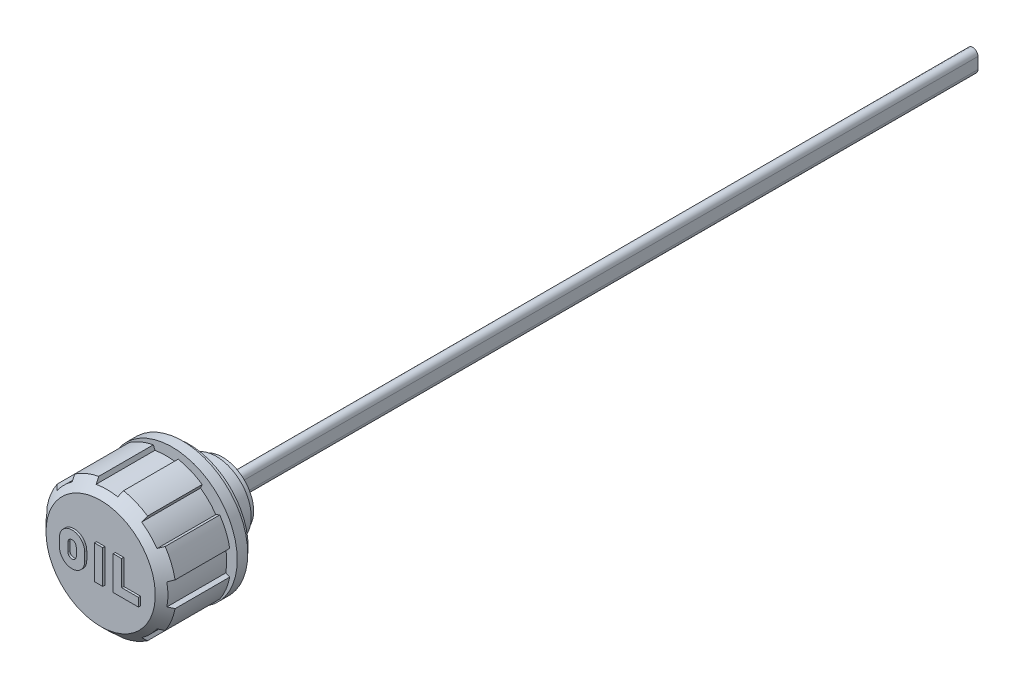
ISO-10303-21;
HEADER;
FILE_DESCRIPTION(('STEP AP214'),'2;1');
FILE_NAME('part.step','',(''),(''),'','','');
FILE_SCHEMA(('AUTOMOTIVE_DESIGN { 1 0 10303 214 1 1 1 1 }'));
ENDSEC;
DATA;
#1=APPLICATION_CONTEXT('core data for automotive mechanical design processes');
#2=APPLICATION_PROTOCOL_DEFINITION('international standard','automotive_design',2000,#1);
#3=PRODUCT_CONTEXT('',#1,'mechanical');
#4=PRODUCT('Part','Part','',(#3));
#5=PRODUCT_RELATED_PRODUCT_CATEGORY('part','',(#4));
#6=PRODUCT_DEFINITION_FORMATION('','',#4);
#7=PRODUCT_DEFINITION_CONTEXT('part definition',#1,'design');
#8=PRODUCT_DEFINITION('design','',#6,#7);
#9=PRODUCT_DEFINITION_SHAPE('','',#8);
#10=(LENGTH_UNIT() NAMED_UNIT(*) SI_UNIT(.MILLI.,.METRE.));
#11=(NAMED_UNIT(*) PLANE_ANGLE_UNIT() SI_UNIT($,.RADIAN.));
#12=(NAMED_UNIT(*) SI_UNIT($,.STERADIAN.) SOLID_ANGLE_UNIT());
#13=UNCERTAINTY_MEASURE_WITH_UNIT(LENGTH_MEASURE(1.E-05),#10,'distance_accuracy_value','');
#14=(GEOMETRIC_REPRESENTATION_CONTEXT(3) GLOBAL_UNCERTAINTY_ASSIGNED_CONTEXT((#13)) GLOBAL_UNIT_ASSIGNED_CONTEXT((#10,
#11,#12)) REPRESENTATION_CONTEXT('',''));
#15=CARTESIAN_POINT('',(0.,0.,0.));
#16=DIRECTION('',(0.,0.,1.));
#17=DIRECTION('',(1.,0.,0.));
#18=AXIS2_PLACEMENT_3D('',#15,#16,#17);
#19=CARTESIAN_POINT('',(0.,0.,4.75));
#20=DIRECTION('',(0.,0.,1.));
#21=DIRECTION('',(1.,0.,0.));
#22=AXIS2_PLACEMENT_3D('',#19,#20,#21);
#23=CYLINDRICAL_SURFACE('',#22,10.3333333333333);
#24=CARTESIAN_POINT('',(0.,0.,4.));
#25=DIRECTION('',(0.,0.,1.));
#26=DIRECTION('',(1.,0.,0.));
#27=AXIS2_PLACEMENT_3D('',#24,#25,#26);
#28=CIRCLE('',#27,10.3333333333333);
#29=CARTESIAN_POINT('',(10.3333333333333,0.,4.));
#30=VERTEX_POINT('',#29);
#31=EDGE_CURVE('E364',#30,#30,#28,.F.);
#32=ORIENTED_EDGE('',*,*,#31,.F.);
#33=EDGE_LOOP('',(#32));
#34=FACE_BOUND('',#33,.T.);
#35=CARTESIAN_POINT('',(0.,0.,5.5));
#36=DIRECTION('',(0.,0.,1.));
#37=DIRECTION('',(1.,0.,0.));
#38=AXIS2_PLACEMENT_3D('',#35,#36,#37);
#39=CIRCLE('',#38,10.3333333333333);
#40=CARTESIAN_POINT('',(10.3333333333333,0.,5.5));
#41=VERTEX_POINT('',#40);
#42=EDGE_CURVE('E17',#41,#41,#39,.F.);
#43=ORIENTED_EDGE('',*,*,#42,.T.);
#44=EDGE_LOOP('',(#43));
#45=FACE_BOUND('',#44,.T.);
#46=ADVANCED_FACE('F14',(#34,#45),#23,.T.);
#47=CARTESIAN_POINT('',(0.,12.9166666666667,4.));
#48=DIRECTION('',(0.,0.,1.));
#49=DIRECTION('',(1.,0.,0.));
#50=AXIS2_PLACEMENT_3D('',#47,#48,#49);
#51=PLANE('',#50);
#52=ORIENTED_EDGE('',*,*,#31,.T.);
#53=EDGE_LOOP('',(#52));
#54=FACE_BOUND('',#53,.T.);
#55=CARTESIAN_POINT('',(0.,0.,4.));
#56=DIRECTION('',(0.,0.,1.));
#57=DIRECTION('',(1.,0.,0.));
#58=AXIS2_PLACEMENT_3D('',#55,#56,#57);
#59=CIRCLE('',#58,15.5);
#60=CARTESIAN_POINT('',(15.5,0.,4.));
#61=VERTEX_POINT('',#60);
#62=EDGE_CURVE('E362',#61,#61,#59,.F.);
#63=ORIENTED_EDGE('',*,*,#62,.F.);
#64=EDGE_LOOP('',(#63));
#65=FACE_BOUND('',#64,.T.);
#66=ADVANCED_FACE('F451',(#54,#65),#51,.T.);
#67=CARTESIAN_POINT('',(0.,0.,2.75));
#68=DIRECTION('',(0.,0.,1.));
#69=DIRECTION('',(1.,0.,0.));
#70=AXIS2_PLACEMENT_3D('',#67,#68,#69);
#71=CYLINDRICAL_SURFACE('',#70,15.5);
#72=CARTESIAN_POINT('',(0.,0.,1.5));
#73=DIRECTION('',(0.,0.,1.));
#74=DIRECTION('',(1.,0.,0.));
#75=AXIS2_PLACEMENT_3D('',#72,#73,#74);
#76=CIRCLE('',#75,15.5);
#77=CARTESIAN_POINT('',(15.5,0.,1.5));
#78=VERTEX_POINT('',#77);
#79=EDGE_CURVE('E359',#78,#78,#76,.F.);
#80=ORIENTED_EDGE('',*,*,#79,.F.);
#81=EDGE_LOOP('',(#80));
#82=FACE_BOUND('',#81,.T.);
#83=ORIENTED_EDGE('',*,*,#62,.T.);
#84=EDGE_LOOP('',(#83));
#85=FACE_BOUND('',#84,.T.);
#86=ADVANCED_FACE('F448',(#82,#85),#71,.T.);
#87=CARTESIAN_POINT('',(0.,14.7954545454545,1.49999999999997));
#88=DIRECTION('',(0.,0.,-1.));
#89=DIRECTION('',(-1.,0.,0.));
#90=AXIS2_PLACEMENT_3D('',#87,#88,#89);
#91=PLANE('',#90);
#92=ORIENTED_EDGE('',*,*,#79,.T.);
#93=EDGE_LOOP('',(#92));
#94=FACE_BOUND('',#93,.T.);
#95=CARTESIAN_POINT('',(0.,0.,1.5));
#96=DIRECTION('',(0.,0.,1.));
#97=DIRECTION('',(1.,0.,0.));
#98=AXIS2_PLACEMENT_3D('',#95,#96,#97);
#99=CIRCLE('',#98,14.0909090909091);
#100=CARTESIAN_POINT('',(14.0909090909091,0.,1.5));
#101=VERTEX_POINT('',#100);
#102=EDGE_CURVE('E356',#101,#101,#99,.F.);
#103=ORIENTED_EDGE('',*,*,#102,.F.);
#104=EDGE_LOOP('',(#103));
#105=FACE_BOUND('',#104,.T.);
#106=ADVANCED_FACE('F444',(#94,#105),#91,.T.);
#107=CARTESIAN_POINT('',(0.,0.,0.75));
#108=DIRECTION('',(0.,0.,1.));
#109=DIRECTION('',(1.,0.,0.));
#110=AXIS2_PLACEMENT_3D('',#107,#108,#109);
#111=CYLINDRICAL_SURFACE('',#110,14.0909090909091);
#112=CARTESIAN_POINT('',(0.,0.,0.));
#113=DIRECTION('',(0.,0.,1.));
#114=DIRECTION('',(1.,0.,0.));
#115=AXIS2_PLACEMENT_3D('',#112,#113,#114);
#116=CIRCLE('',#115,14.0909090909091);
#117=CARTESIAN_POINT('',(14.0909090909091,0.,0.));
#118=VERTEX_POINT('',#117);
#119=EDGE_CURVE('E353',#118,#118,#116,.F.);
#120=ORIENTED_EDGE('',*,*,#119,.F.);
#121=EDGE_LOOP('',(#120));
#122=FACE_BOUND('',#121,.T.);
#123=ORIENTED_EDGE('',*,*,#102,.T.);
#124=EDGE_LOOP('',(#123));
#125=FACE_BOUND('',#124,.T.);
#126=ADVANCED_FACE('F440',(#122,#125),#111,.T.);
#127=CARTESIAN_POINT('',(0.,11.2104545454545,0.));
#128=DIRECTION('',(0.,0.,-1.));
#129=DIRECTION('',(-1.,0.,0.));
#130=AXIS2_PLACEMENT_3D('',#127,#128,#129);
#131=PLANE('',#130);
#132=ORIENTED_EDGE('',*,*,#119,.T.);
#133=EDGE_LOOP('',(#132));
#134=FACE_BOUND('',#133,.T.);
#135=CARTESIAN_POINT('',(0.,0.,0.));
#136=DIRECTION('',(0.,0.,1.));
#137=DIRECTION('',(1.,0.,0.));
#138=AXIS2_PLACEMENT_3D('',#135,#136,#137);
#139=CIRCLE('',#138,8.33);
#140=CARTESIAN_POINT('',(8.33,0.,0.));
#141=VERTEX_POINT('',#140);
#142=EDGE_CURVE('E350',#141,#141,#139,.F.);
#143=ORIENTED_EDGE('',*,*,#142,.F.);
#144=EDGE_LOOP('',(#143));
#145=FACE_BOUND('',#144,.T.);
#146=ADVANCED_FACE('F436',(#134,#145),#131,.T.);
#147=CARTESIAN_POINT('',(0.,0.,-3.25));
#148=DIRECTION('',(0.,0.,1.));
#149=DIRECTION('',(1.,0.,0.));
#150=AXIS2_PLACEMENT_3D('',#147,#148,#149);
#151=CYLINDRICAL_SURFACE('',#150,8.33);
#152=CARTESIAN_POINT('',(0.,0.,-6.5));
#153=DIRECTION('',(0.,0.,1.));
#154=DIRECTION('',(1.,0.,0.));
#155=AXIS2_PLACEMENT_3D('',#152,#153,#154);
#156=CIRCLE('',#155,8.33);
#157=CARTESIAN_POINT('',(8.33,0.,-6.5));
#158=VERTEX_POINT('',#157);
#159=EDGE_CURVE('E347',#158,#158,#156,.F.);
#160=ORIENTED_EDGE('',*,*,#159,.F.);
#161=EDGE_LOOP('',(#160));
#162=FACE_BOUND('',#161,.T.);
#163=ORIENTED_EDGE('',*,*,#142,.T.);
#164=EDGE_LOOP('',(#163));
#165=FACE_BOUND('',#164,.T.);
#166=ADVANCED_FACE('F432',(#162,#165),#151,.T.);
#167=CARTESIAN_POINT('',(0.,7.86992374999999,-6.5));
#168=DIRECTION('',(0.,0.,-1.));
#169=DIRECTION('',(-1.,0.,0.));
#170=AXIS2_PLACEMENT_3D('',#167,#168,#169);
#171=PLANE('',#170);
#172=ORIENTED_EDGE('',*,*,#159,.T.);
#173=EDGE_LOOP('',(#172));
#174=FACE_BOUND('',#173,.T.);
#175=CARTESIAN_POINT('',(0.,0.,-6.5));
#176=DIRECTION('',(0.,0.,1.));
#177=DIRECTION('',(1.,0.,0.));
#178=AXIS2_PLACEMENT_3D('',#175,#176,#177);
#179=CIRCLE('',#178,7.4098475);
#180=CARTESIAN_POINT('',(7.4098475,0.,-6.5));
#181=VERTEX_POINT('',#180);
#182=EDGE_CURVE('E344',#181,#181,#179,.F.);
#183=ORIENTED_EDGE('',*,*,#182,.F.);
#184=EDGE_LOOP('',(#183));
#185=FACE_BOUND('',#184,.T.);
#186=ADVANCED_FACE('F428',(#174,#185),#171,.T.);
#187=CARTESIAN_POINT('',(0.,0.,-7.25));
#188=DIRECTION('',(0.,0.,1.));
#189=DIRECTION('',(1.,0.,0.));
#190=AXIS2_PLACEMENT_3D('',#187,#188,#189);
#191=CYLINDRICAL_SURFACE('',#190,7.4098475);
#192=CARTESIAN_POINT('',(0.,0.,-8.));
#193=DIRECTION('',(0.,0.,1.));
#194=DIRECTION('',(1.,0.,0.));
#195=AXIS2_PLACEMENT_3D('',#192,#193,#194);
#196=CIRCLE('',#195,7.4098475);
#197=CARTESIAN_POINT('',(7.4098475,0.,-8.));
#198=VERTEX_POINT('',#197);
#199=EDGE_CURVE('E341',#198,#198,#196,.F.);
#200=ORIENTED_EDGE('',*,*,#199,.F.);
#201=EDGE_LOOP('',(#200));
#202=FACE_BOUND('',#201,.T.);
#203=ORIENTED_EDGE('',*,*,#182,.T.);
#204=EDGE_LOOP('',(#203));
#205=FACE_BOUND('',#204,.T.);
#206=ADVANCED_FACE('F424',(#202,#205),#191,.T.);
#207=CARTESIAN_POINT('',(0.,6.20492374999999,-8.));
#208=DIRECTION('',(0.,0.,-1.));
#209=DIRECTION('',(-1.,0.,0.));
#210=AXIS2_PLACEMENT_3D('',#207,#208,#209);
#211=PLANE('',#210);
#212=ORIENTED_EDGE('',*,*,#199,.T.);
#213=EDGE_LOOP('',(#212));
#214=FACE_BOUND('',#213,.T.);
#215=CARTESIAN_POINT('',(0.,0.,-8.));
#216=DIRECTION('',(0.,0.,1.));
#217=DIRECTION('',(1.,0.,0.));
#218=AXIS2_PLACEMENT_3D('',#215,#216,#217);
#219=CIRCLE('',#218,5.);
#220=CARTESIAN_POINT('',(5.,0.,-8.));
#221=VERTEX_POINT('',#220);
#222=EDGE_CURVE('E309',#221,#221,#219,.T.);
#223=ORIENTED_EDGE('',*,*,#222,.T.);
#224=EDGE_LOOP('',(#223));
#225=FACE_BOUND('',#224,.T.);
#226=ADVANCED_FACE('F420',(#214,#225),#211,.T.);
#227=CARTESIAN_POINT('',(0.,0.,-2.));
#228=DIRECTION('',(0.,0.,1.));
#229=DIRECTION('',(1.,0.,0.));
#230=AXIS2_PLACEMENT_3D('',#227,#228,#229);
#231=CYLINDRICAL_SURFACE('',#230,5.);
#232=CARTESIAN_POINT('',(0.,0.,4.));
#233=DIRECTION('',(0.,0.,1.));
#234=DIRECTION('',(1.,0.,0.));
#235=AXIS2_PLACEMENT_3D('',#232,#233,#234);
#236=CIRCLE('',#235,5.);
#237=CARTESIAN_POINT('',(5.,0.,4.));
#238=VERTEX_POINT('',#237);
#239=EDGE_CURVE('E308',#238,#238,#236,.F.);
#240=ORIENTED_EDGE('',*,*,#239,.F.);
#241=EDGE_LOOP('',(#240));
#242=FACE_BOUND('',#241,.T.);
#243=ORIENTED_EDGE('',*,*,#222,.F.);
#244=EDGE_LOOP('',(#243));
#245=FACE_BOUND('',#244,.T.);
#246=ADVANCED_FACE('F414',(#242,#245),#231,.F.);
#247=CARTESIAN_POINT('',(0.,2.5,4.));
#248=DIRECTION('',(0.,0.,-1.));
#249=DIRECTION('',(-1.,0.,0.));
#250=AXIS2_PLACEMENT_3D('',#247,#248,#249);
#251=PLANE('',#250);
#252=ORIENTED_EDGE('',*,*,#239,.T.);
#253=EDGE_LOOP('',(#252));
#254=FACE_BOUND('',#253,.T.);
#255=CARTESIAN_POINT('',(0.,1.35,4.));
#256=DIRECTION('',(0.,0.,1.));
#257=DIRECTION('',(1.,0.,0.));
#258=AXIS2_PLACEMENT_3D('',#255,#256,#257);
#259=CIRCLE('',#258,1.25);
#260=CARTESIAN_POINT('',(1.25,1.35,4.));
#261=VERTEX_POINT('',#260);
#262=CARTESIAN_POINT('',(-1.25,1.35,4.));
#263=VERTEX_POINT('',#262);
#264=EDGE_CURVE('E298',#261,#263,#259,.T.);
#265=ORIENTED_EDGE('',*,*,#264,.T.);
#266=DIRECTION('',(0.,1.,0.));
#267=VECTOR('',#266,1.);
#268=CARTESIAN_POINT('',(-1.25,1.35,4.));
#269=LINE('',#268,#267);
#270=CARTESIAN_POINT('',(-1.25,-1.35,4.));
#271=VERTEX_POINT('',#270);
#272=EDGE_CURVE('E331',#271,#263,#269,.T.);
#273=ORIENTED_EDGE('',*,*,#272,.F.);
#274=CARTESIAN_POINT('',(0.,-1.35,4.));
#275=DIRECTION('',(0.,0.,1.));
#276=DIRECTION('',(1.,0.,0.));
#277=AXIS2_PLACEMENT_3D('',#274,#275,#276);
#278=CIRCLE('',#277,1.25);
#279=CARTESIAN_POINT('',(1.25,-1.35,4.));
#280=VERTEX_POINT('',#279);
#281=EDGE_CURVE('E315',#280,#271,#278,.F.);
#282=ORIENTED_EDGE('',*,*,#281,.F.);
#283=DIRECTION('',(0.,1.,0.));
#284=VECTOR('',#283,1.);
#285=CARTESIAN_POINT('',(1.25,-1.35,4.));
#286=LINE('',#285,#284);
#287=EDGE_CURVE('E312',#261,#280,#286,.F.);
#288=ORIENTED_EDGE('',*,*,#287,.F.);
#289=EDGE_LOOP('',(#265,#273,#282,#288));
#290=FACE_BOUND('',#289,.T.);
#291=ADVANCED_FACE('F313',(#254,#290),#251,.T.);
#292=CARTESIAN_POINT('',(0.,1.35000000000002,11.));
#293=DIRECTION('',(0.,0.,1.));
#294=DIRECTION('',(1.,0.,0.));
#295=AXIS2_PLACEMENT_3D('',#292,#293,#294);
#296=CYLINDRICAL_SURFACE('',#295,1.25);
#297=CARTESIAN_POINT('',(0.,1.3499999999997,-186.5));
#298=DIRECTION('',(0.,0.,1.));
#299=DIRECTION('',(1.,0.,0.));
#300=AXIS2_PLACEMENT_3D('',#297,#298,#299);
#301=CIRCLE('',#300,1.25);
#302=CARTESIAN_POINT('',(1.25,1.3499999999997,-186.5));
#303=VERTEX_POINT('',#302);
#304=CARTESIAN_POINT('',(-1.25,1.3499999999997,-186.5));
#305=VERTEX_POINT('',#304);
#306=EDGE_CURVE('E330',#303,#305,#301,.T.);
#307=ORIENTED_EDGE('',*,*,#306,.T.);
#308=DIRECTION('',(0.,0.,1.));
#309=VECTOR('',#308,1.);
#310=CARTESIAN_POINT('',(-1.25,1.35000000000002,11.));
#311=LINE('',#310,#309);
#312=EDGE_CURVE('E305',#263,#305,#311,.F.);
#313=ORIENTED_EDGE('',*,*,#312,.F.);
#314=ORIENTED_EDGE('',*,*,#264,.F.);
#315=DIRECTION('',(0.,0.,-1.));
#316=VECTOR('',#315,1.);
#317=CARTESIAN_POINT('',(1.25,1.35000000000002,11.));
#318=LINE('',#317,#316);
#319=EDGE_CURVE('E302',#303,#261,#318,.F.);
#320=ORIENTED_EDGE('',*,*,#319,.F.);
#321=EDGE_LOOP('',(#307,#313,#314,#320));
#322=FACE_BOUND('',#321,.T.);
#323=ADVANCED_FACE('F300',(#322),#296,.T.);
#324=CARTESIAN_POINT('',(-1.25,1.35000000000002,11.));
#325=DIRECTION('',(-1.,0.,0.));
#326=DIRECTION('',(0.,0.,1.));
#327=AXIS2_PLACEMENT_3D('',#324,#325,#326);
#328=PLANE('',#327);
#329=DIRECTION('',(0.,1.,0.));
#330=VECTOR('',#329,1.);
#331=CARTESIAN_POINT('',(-1.25,-2.98639318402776E-13,-186.5));
#332=LINE('',#331,#330);
#333=CARTESIAN_POINT('',(-1.25,-1.3500000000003,-186.5));
#334=VERTEX_POINT('',#333);
#335=EDGE_CURVE('E320',#305,#334,#332,.F.);
#336=ORIENTED_EDGE('',*,*,#335,.T.);
#337=DIRECTION('',(0.,0.,1.));
#338=VECTOR('',#337,1.);
#339=CARTESIAN_POINT('',(-1.25,-1.34999999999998,11.));
#340=LINE('',#339,#338);
#341=EDGE_CURVE('E324',#271,#334,#340,.F.);
#342=ORIENTED_EDGE('',*,*,#341,.F.);
#343=ORIENTED_EDGE('',*,*,#272,.T.);
#344=ORIENTED_EDGE('',*,*,#312,.T.);
#345=EDGE_LOOP('',(#336,#342,#343,#344));
#346=FACE_BOUND('',#345,.T.);
#347=ADVANCED_FACE('F388',(#346),#328,.T.);
#348=CARTESIAN_POINT('',(0.,-1.34999999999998,11.));
#349=DIRECTION('',(0.,0.,1.));
#350=DIRECTION('',(1.,0.,0.));
#351=AXIS2_PLACEMENT_3D('',#348,#349,#350);
#352=CYLINDRICAL_SURFACE('',#351,1.25);
#353=CARTESIAN_POINT('',(0.,-1.3500000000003,-186.5));
#354=DIRECTION('',(0.,0.,1.));
#355=DIRECTION('',(1.,0.,0.));
#356=AXIS2_PLACEMENT_3D('',#353,#354,#355);
#357=CIRCLE('',#356,1.25);
#358=CARTESIAN_POINT('',(1.25,-1.3500000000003,-186.5));
#359=VERTEX_POINT('',#358);
#360=EDGE_CURVE('E332',#334,#359,#357,.T.);
#361=ORIENTED_EDGE('',*,*,#360,.T.);
#362=DIRECTION('',(0.,0.,1.));
#363=VECTOR('',#362,1.);
#364=CARTESIAN_POINT('',(1.25,-1.34999999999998,11.));
#365=LINE('',#364,#363);
#366=EDGE_CURVE('E334',#359,#280,#365,.T.);
#367=ORIENTED_EDGE('',*,*,#366,.T.);
#368=ORIENTED_EDGE('',*,*,#281,.T.);
#369=ORIENTED_EDGE('',*,*,#341,.T.);
#370=EDGE_LOOP('',(#361,#367,#368,#369));
#371=FACE_BOUND('',#370,.T.);
#372=ADVANCED_FACE('F377',(#371),#352,.T.);
#373=CARTESIAN_POINT('',(1.25,-1.34999999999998,11.));
#374=DIRECTION('',(1.,0.,0.));
#375=DIRECTION('',(0.,0.,-1.));
#376=AXIS2_PLACEMENT_3D('',#373,#374,#375);
#377=PLANE('',#376);
#378=DIRECTION('',(0.,1.,0.));
#379=VECTOR('',#378,1.);
#380=CARTESIAN_POINT('',(1.25,-1.3500000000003,-186.5));
#381=LINE('',#380,#379);
#382=EDGE_CURVE('E319',#359,#303,#381,.T.);
#383=ORIENTED_EDGE('',*,*,#382,.T.);
#384=ORIENTED_EDGE('',*,*,#319,.T.);
#385=ORIENTED_EDGE('',*,*,#287,.T.);
#386=ORIENTED_EDGE('',*,*,#366,.F.);
#387=EDGE_LOOP('',(#383,#384,#385,#386));
#388=FACE_BOUND('',#387,.T.);
#389=ADVANCED_FACE('F322',(#388),#377,.T.);
#390=CARTESIAN_POINT('',(0.,-2.98639318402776E-13,-186.5));
#391=DIRECTION('',(0.,0.,1.));
#392=DIRECTION('',(1.,0.,0.));
#393=AXIS2_PLACEMENT_3D('',#390,#391,#392);
#394=PLANE('',#393);
#395=ORIENTED_EDGE('',*,*,#335,.F.);
#396=ORIENTED_EDGE('',*,*,#306,.F.);
#397=ORIENTED_EDGE('',*,*,#382,.F.);
#398=ORIENTED_EDGE('',*,*,#360,.F.);
#399=EDGE_LOOP('',(#395,#396,#397,#398));
#400=FACE_BOUND('',#399,.T.);
#401=ADVANCED_FACE('F375',(#400),#394,.F.);
#402=CARTESIAN_POINT('',(0.,14.95,5.5));
#403=DIRECTION('',(0.,0.,-1.));
#404=DIRECTION('',(-1.,0.,0.));
#405=AXIS2_PLACEMENT_3D('',#402,#403,#404);
#406=PLANE('',#405);
#407=DIRECTION('',(-0.927183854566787,0.374606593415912,0.));
#408=VECTOR('',#407,1.);
#409=CARTESIAN_POINT('',(-14.2694497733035,2.57542291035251,5.5));
#410=LINE('',#409,#408);
#411=CARTESIAN_POINT('',(-14.2694497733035,2.5754229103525,5.5));
#412=VERTEX_POINT('',#411);
#413=CARTESIAN_POINT('',(-15.2152213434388,2.95753942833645,5.5));
#414=VERTEX_POINT('',#413);
#415=EDGE_CURVE('E31',#412,#414,#410,.T.);
#416=ORIENTED_EDGE('',*,*,#415,.T.);
#417=CARTESIAN_POINT('',(0.,0.,5.5));
#418=DIRECTION('',(0.,0.,1.));
#419=DIRECTION('',(1.,0.,0.));
#420=AXIS2_PLACEMENT_3D('',#417,#418,#419);
#421=CIRCLE('',#420,15.5);
#422=CARTESIAN_POINT('',(-12.8500823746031,8.66749000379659,5.5));
#423=VERTEX_POINT('',#422);
#424=EDGE_CURVE('E9',#414,#423,#421,.F.);
#425=ORIENTED_EDGE('',*,*,#424,.T.);
#426=DIRECTION('',(0.92050485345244,-0.390731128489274,0.));
#427=VECTOR('',#426,1.);
#428=CARTESIAN_POINT('',(-12.8500823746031,8.66749000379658,5.5));
#429=LINE('',#428,#427);
#430=CARTESIAN_POINT('',(-11.9111237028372,8.26892569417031,5.5));
#431=VERTEX_POINT('',#430);
#432=EDGE_CURVE('E1346',#423,#431,#429,.T.);
#433=ORIENTED_EDGE('',*,*,#432,.T.);
#434=CARTESIAN_POINT('',(0.,0.,5.5));
#435=DIRECTION('',(0.,0.,1.));
#436=DIRECTION('',(1.,0.,0.));
#437=AXIS2_PLACEMENT_3D('',#434,#435,#436);
#438=CIRCLE('',#437,14.5);
#439=CARTESIAN_POINT('',(-8.26892569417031,11.9111237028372,5.5));
#440=VERTEX_POINT('',#439);
#441=EDGE_CURVE('E1194',#431,#440,#438,.F.);
#442=ORIENTED_EDGE('',*,*,#441,.T.);
#443=DIRECTION('',(-0.390731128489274,0.92050485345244,0.));
#444=VECTOR('',#443,1.);
#445=CARTESIAN_POINT('',(-8.26892569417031,11.9111237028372,5.5));
#446=LINE('',#445,#444);
#447=CARTESIAN_POINT('',(-8.66749000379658,12.8500823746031,5.5));
#448=VERTEX_POINT('',#447);
#449=EDGE_CURVE('E1426',#440,#448,#446,.T.);
#450=ORIENTED_EDGE('',*,*,#449,.T.);
#451=CARTESIAN_POINT('',(0.,0.,5.5));
#452=DIRECTION('',(0.,0.,1.));
#453=DIRECTION('',(1.,0.,0.));
#454=AXIS2_PLACEMENT_3D('',#451,#452,#453);
#455=CIRCLE('',#454,15.5);
#456=CARTESIAN_POINT('',(-2.95753942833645,15.2152213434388,5.5));
#457=VERTEX_POINT('',#456);
#458=EDGE_CURVE('E1191',#448,#457,#455,.F.);
#459=ORIENTED_EDGE('',*,*,#458,.T.);
#460=DIRECTION('',(0.374606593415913,-0.927183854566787,0.));
#461=VECTOR('',#460,1.);
#462=CARTESIAN_POINT('',(-2.95753942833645,15.2152213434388,5.5));
#463=LINE('',#462,#461);
#464=CARTESIAN_POINT('',(-2.5754229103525,14.2694497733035,5.5));
#465=VERTEX_POINT('',#464);
#466=EDGE_CURVE('E1419',#457,#465,#463,.T.);
#467=ORIENTED_EDGE('',*,*,#466,.T.);
#468=CARTESIAN_POINT('',(0.,0.,5.5));
#469=DIRECTION('',(0.,0.,1.));
#470=DIRECTION('',(1.,0.,0.));
#471=AXIS2_PLACEMENT_3D('',#468,#469,#470);
#472=CIRCLE('',#471,14.5);
#473=CARTESIAN_POINT('',(2.5754229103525,14.2694497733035,5.5));
#474=VERTEX_POINT('',#473);
#475=EDGE_CURVE('E1188',#465,#474,#472,.F.);
#476=ORIENTED_EDGE('',*,*,#475,.T.);
#477=DIRECTION('',(0.374606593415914,0.927183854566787,0.));
#478=VECTOR('',#477,1.);
#479=CARTESIAN_POINT('',(2.5754229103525,14.2694497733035,5.5));
#480=LINE('',#479,#478);
#481=CARTESIAN_POINT('',(2.95753942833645,15.2152213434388,5.5));
#482=VERTEX_POINT('',#481);
#483=EDGE_CURVE('E1412',#474,#482,#480,.T.);
#484=ORIENTED_EDGE('',*,*,#483,.T.);
#485=CARTESIAN_POINT('',(0.,0.,5.5));
#486=DIRECTION('',(0.,0.,1.));
#487=DIRECTION('',(1.,0.,0.));
#488=AXIS2_PLACEMENT_3D('',#485,#486,#487);
#489=CIRCLE('',#488,15.5);
#490=CARTESIAN_POINT('',(8.6674900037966,12.8500823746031,5.5));
#491=VERTEX_POINT('',#490);
#492=EDGE_CURVE('E1185',#482,#491,#489,.F.);
#493=ORIENTED_EDGE('',*,*,#492,.T.);
#494=DIRECTION('',(-0.390731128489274,-0.92050485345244,0.));
#495=VECTOR('',#494,1.);
#496=CARTESIAN_POINT('',(8.66749000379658,12.8500823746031,5.5));
#497=LINE('',#496,#495);
#498=CARTESIAN_POINT('',(8.26892569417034,11.9111237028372,5.5));
#499=VERTEX_POINT('',#498);
#500=EDGE_CURVE('E1405',#491,#499,#497,.T.);
#501=ORIENTED_EDGE('',*,*,#500,.T.);
#502=CARTESIAN_POINT('',(0.,0.,5.5));
#503=DIRECTION('',(0.,0.,1.));
#504=DIRECTION('',(1.,0.,0.));
#505=AXIS2_PLACEMENT_3D('',#502,#503,#504);
#506=CIRCLE('',#505,14.5);
#507=CARTESIAN_POINT('',(11.9111237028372,8.26892569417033,5.5));
#508=VERTEX_POINT('',#507);
#509=EDGE_CURVE('E1182',#499,#508,#506,.F.);
#510=ORIENTED_EDGE('',*,*,#509,.T.);
#511=DIRECTION('',(0.92050485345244,0.390731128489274,0.));
#512=VECTOR('',#511,1.);
#513=CARTESIAN_POINT('',(11.9111237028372,8.26892569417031,5.5));
#514=LINE('',#513,#512);
#515=CARTESIAN_POINT('',(12.8500823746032,8.66749000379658,5.5));
#516=VERTEX_POINT('',#515);
#517=EDGE_CURVE('E1398',#508,#516,#514,.T.);
#518=ORIENTED_EDGE('',*,*,#517,.T.);
#519=CARTESIAN_POINT('',(0.,0.,5.5));
#520=DIRECTION('',(0.,0.,1.));
#521=DIRECTION('',(1.,0.,0.));
#522=AXIS2_PLACEMENT_3D('',#519,#520,#521);
#523=CIRCLE('',#522,15.5);
#524=CARTESIAN_POINT('',(15.2152213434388,2.95753942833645,5.5));
#525=VERTEX_POINT('',#524);
#526=EDGE_CURVE('E1179',#516,#525,#523,.F.);
#527=ORIENTED_EDGE('',*,*,#526,.T.);
#528=DIRECTION('',(-0.927183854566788,-0.374606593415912,0.));
#529=VECTOR('',#528,1.);
#530=CARTESIAN_POINT('',(15.2152213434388,2.95753942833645,5.5));
#531=LINE('',#530,#529);
#532=CARTESIAN_POINT('',(14.2694497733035,2.57542291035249,5.5));
#533=VERTEX_POINT('',#532);
#534=EDGE_CURVE('E1391',#525,#533,#531,.T.);
#535=ORIENTED_EDGE('',*,*,#534,.T.);
#536=CARTESIAN_POINT('',(0.,0.,5.5));
#537=DIRECTION('',(0.,0.,1.));
#538=DIRECTION('',(1.,0.,0.));
#539=AXIS2_PLACEMENT_3D('',#536,#537,#538);
#540=CIRCLE('',#539,14.5);
#541=CARTESIAN_POINT('',(14.2694497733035,-2.57542291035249,5.5));
#542=VERTEX_POINT('',#541);
#543=EDGE_CURVE('E1176',#533,#542,#540,.F.);
#544=ORIENTED_EDGE('',*,*,#543,.T.);
#545=DIRECTION('',(0.927183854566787,-0.374606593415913,0.));
#546=VECTOR('',#545,1.);
#547=CARTESIAN_POINT('',(14.2694497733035,-2.5754229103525,5.5));
#548=LINE('',#547,#546);
#549=CARTESIAN_POINT('',(15.2152213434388,-2.95753942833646,5.5));
#550=VERTEX_POINT('',#549);
#551=EDGE_CURVE('E1384',#542,#550,#548,.T.);
#552=ORIENTED_EDGE('',*,*,#551,.T.);
#553=CARTESIAN_POINT('',(0.,0.,5.5));
#554=DIRECTION('',(0.,0.,1.));
#555=DIRECTION('',(1.,0.,0.));
#556=AXIS2_PLACEMENT_3D('',#553,#554,#555);
#557=CIRCLE('',#556,15.5);
#558=CARTESIAN_POINT('',(12.8500823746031,-8.6674900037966,5.5));
#559=VERTEX_POINT('',#558);
#560=EDGE_CURVE('E1173',#550,#559,#557,.F.);
#561=ORIENTED_EDGE('',*,*,#560,.T.);
#562=DIRECTION('',(-0.92050485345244,0.390731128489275,0.));
#563=VECTOR('',#562,1.);
#564=CARTESIAN_POINT('',(12.8500823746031,-8.66749000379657,5.5));
#565=LINE('',#564,#563);
#566=CARTESIAN_POINT('',(11.9111237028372,-8.26892569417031,5.5));
#567=VERTEX_POINT('',#566);
#568=EDGE_CURVE('E1377',#559,#567,#565,.T.);
#569=ORIENTED_EDGE('',*,*,#568,.T.);
#570=CARTESIAN_POINT('',(0.,0.,5.5));
#571=DIRECTION('',(0.,0.,1.));
#572=DIRECTION('',(1.,0.,0.));
#573=AXIS2_PLACEMENT_3D('',#570,#571,#572);
#574=CIRCLE('',#573,14.5);
#575=CARTESIAN_POINT('',(8.26892569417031,-11.9111237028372,5.5));
#576=VERTEX_POINT('',#575);
#577=EDGE_CURVE('E1170',#567,#576,#574,.F.);
#578=ORIENTED_EDGE('',*,*,#577,.T.);
#579=DIRECTION('',(0.390731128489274,-0.92050485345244,0.));
#580=VECTOR('',#579,1.);
#581=CARTESIAN_POINT('',(8.2689256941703,-11.9111237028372,5.5));
#582=LINE('',#581,#580);
#583=CARTESIAN_POINT('',(8.66749000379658,-12.8500823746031,5.5));
#584=VERTEX_POINT('',#583);
#585=EDGE_CURVE('E1371',#576,#584,#582,.T.);
#586=ORIENTED_EDGE('',*,*,#585,.T.);
#587=CARTESIAN_POINT('',(0.,0.,5.5));
#588=DIRECTION('',(0.,0.,1.));
#589=DIRECTION('',(1.,0.,0.));
#590=AXIS2_PLACEMENT_3D('',#587,#588,#589);
#591=CIRCLE('',#590,15.5);
#592=CARTESIAN_POINT('',(2.95753942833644,-15.2152213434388,5.5));
#593=VERTEX_POINT('',#592);
#594=EDGE_CURVE('E1167',#584,#593,#591,.F.);
#595=ORIENTED_EDGE('',*,*,#594,.T.);
#596=DIRECTION('',(-0.374606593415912,0.927183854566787,0.));
#597=VECTOR('',#596,1.);
#598=CARTESIAN_POINT('',(2.95753942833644,-15.2152213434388,5.5));
#599=LINE('',#598,#597);
#600=CARTESIAN_POINT('',(2.57542291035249,-14.2694497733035,5.5));
#601=VERTEX_POINT('',#600);
#602=EDGE_CURVE('E1369',#593,#601,#599,.T.);
#603=ORIENTED_EDGE('',*,*,#602,.T.);
#604=CARTESIAN_POINT('',(0.,0.,5.5));
#605=DIRECTION('',(0.,0.,1.));
#606=DIRECTION('',(1.,0.,0.));
#607=AXIS2_PLACEMENT_3D('',#604,#605,#606);
#608=CIRCLE('',#607,14.5);
#609=CARTESIAN_POINT('',(-2.57542291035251,-14.2694497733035,5.5));
#610=VERTEX_POINT('',#609);
#611=EDGE_CURVE('E1164',#601,#610,#608,.F.);
#612=ORIENTED_EDGE('',*,*,#611,.T.);
#613=DIRECTION('',(-0.374606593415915,-0.927183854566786,0.));
#614=VECTOR('',#613,1.);
#615=CARTESIAN_POINT('',(-2.5754229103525,-14.2694497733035,5.5));
#616=LINE('',#615,#614);
#617=CARTESIAN_POINT('',(-2.95753942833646,-15.2152213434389,5.5));
#618=VERTEX_POINT('',#617);
#619=EDGE_CURVE('E1357',#610,#618,#616,.T.);
#620=ORIENTED_EDGE('',*,*,#619,.T.);
#621=CARTESIAN_POINT('',(0.,-1.15537921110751E-13,5.5));
#622=DIRECTION('',(0.,0.,1.));
#623=DIRECTION('',(1.,0.,0.));
#624=AXIS2_PLACEMENT_3D('',#621,#622,#623);
#625=CIRCLE('',#624,15.5);
#626=CARTESIAN_POINT('',(-8.66749000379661,-12.8500823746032,5.5));
#627=VERTEX_POINT('',#626);
#628=EDGE_CURVE('E1161',#618,#627,#625,.F.);
#629=ORIENTED_EDGE('',*,*,#628,.T.);
#630=DIRECTION('',(0.390731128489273,0.920504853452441,0.));
#631=VECTOR('',#630,1.);
#632=CARTESIAN_POINT('',(-8.66749000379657,-12.8500823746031,5.5));
#633=LINE('',#632,#631);
#634=CARTESIAN_POINT('',(-8.2689256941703,-11.9111237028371,5.5));
#635=VERTEX_POINT('',#634);
#636=EDGE_CURVE('E1342',#627,#635,#633,.T.);
#637=ORIENTED_EDGE('',*,*,#636,.T.);
#638=CARTESIAN_POINT('',(-1.01252339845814E-13,-1.22643348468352E-13,5.5));
#639=DIRECTION('',(0.,0.,1.));
#640=DIRECTION('',(1.,0.,0.));
#641=AXIS2_PLACEMENT_3D('',#638,#639,#640);
#642=CIRCLE('',#641,14.4999999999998);
#643=CARTESIAN_POINT('',(-11.9111237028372,-8.26892569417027,5.5));
#644=VERTEX_POINT('',#643);
#645=EDGE_CURVE('E1158',#635,#644,#642,.F.);
#646=ORIENTED_EDGE('',*,*,#645,.T.);
#647=DIRECTION('',(-0.920504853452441,-0.390731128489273,0.));
#648=VECTOR('',#647,1.);
#649=CARTESIAN_POINT('',(-11.9111237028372,-8.26892569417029,5.5));
#650=LINE('',#649,#648);
#651=CARTESIAN_POINT('',(-12.8500823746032,-8.66749000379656,5.5));
#652=VERTEX_POINT('',#651);
#653=EDGE_CURVE('E1322',#644,#652,#650,.T.);
#654=ORIENTED_EDGE('',*,*,#653,.T.);
#655=CARTESIAN_POINT('',(0.,0.,5.5));
#656=DIRECTION('',(0.,0.,1.));
#657=DIRECTION('',(1.,0.,0.));
#658=AXIS2_PLACEMENT_3D('',#655,#656,#657);
#659=CIRCLE('',#658,15.5);
#660=CARTESIAN_POINT('',(-15.2152213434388,-2.95753942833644,5.5));
#661=VERTEX_POINT('',#660);
#662=EDGE_CURVE('E1155',#652,#661,#659,.F.);
#663=ORIENTED_EDGE('',*,*,#662,.T.);
#664=DIRECTION('',(0.927183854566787,0.374606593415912,0.));
#665=VECTOR('',#664,1.);
#666=CARTESIAN_POINT('',(-15.2152213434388,-2.95753942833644,5.5));
#667=LINE('',#666,#665);
#668=CARTESIAN_POINT('',(-14.2694497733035,-2.57542291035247,5.5));
#669=VERTEX_POINT('',#668);
#670=EDGE_CURVE('E1318',#661,#669,#667,.T.);
#671=ORIENTED_EDGE('',*,*,#670,.T.);
#672=CARTESIAN_POINT('',(0.,0.,5.5));
#673=DIRECTION('',(0.,0.,1.));
#674=DIRECTION('',(1.,0.,0.));
#675=AXIS2_PLACEMENT_3D('',#672,#673,#674);
#676=CIRCLE('',#675,14.5);
#677=EDGE_CURVE('E23',#669,#412,#676,.F.);
#678=ORIENTED_EDGE('',*,*,#677,.T.);
#679=EDGE_LOOP('',(#416,#425,#433,#442,#450,#459,#467,#476,#484,#493,#501,#510,#518,#527,#535,
#544,#552,#561,#569,#578,#586,#595,#603,#612,#620,#629,#637,#646,#654,#663,#671,#678));
#680=FACE_BOUND('',#679,.T.);
#681=ORIENTED_EDGE('',*,*,#42,.F.);
#682=EDGE_LOOP('',(#681));
#683=FACE_BOUND('',#682,.T.);
#684=ADVANCED_FACE('F372',(#680,#683),#406,.T.);
#685=CARTESIAN_POINT('',(-14.2694497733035,2.57542291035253,21.5));
#686=DIRECTION('',(0.374606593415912,0.927183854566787,0.));
#687=DIRECTION('',(-0.927183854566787,0.374606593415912,0.));
#688=AXIS2_PLACEMENT_3D('',#685,#686,#687);
#689=PLANE('',#688);
#690=DIRECTION('',(0.,0.,1.));
#691=VECTOR('',#690,1.);
#692=CARTESIAN_POINT('',(-15.2152213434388,2.95753942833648,21.5));
#693=LINE('',#692,#691);
#694=CARTESIAN_POINT('',(-15.2152213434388,2.95753942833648,18.5));
#695=VERTEX_POINT('',#694);
#696=EDGE_CURVE('E1197',#414,#695,#693,.T.);
#697=ORIENTED_EDGE('',*,*,#696,.F.);
#698=ORIENTED_EDGE('',*,*,#415,.F.);
#699=DIRECTION('',(0.,0.,1.));
#700=VECTOR('',#699,1.);
#701=CARTESIAN_POINT('',(-14.2694497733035,2.57542291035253,21.5));
#702=LINE('',#701,#700);
#703=CARTESIAN_POINT('',(-14.2694497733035,2.57542291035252,19.5));
#704=VERTEX_POINT('',#703);
#705=EDGE_CURVE('E1349',#704,#412,#702,.F.);
#706=ORIENTED_EDGE('',*,*,#705,.F.);
#707=CARTESIAN_POINT('',(-15.2152213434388,2.95753942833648,18.5));
#708=CARTESIAN_POINT('',(-15.0576970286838,2.89389547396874,18.6667813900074));
#709=CARTESIAN_POINT('',(-14.9001205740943,2.83023045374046,18.8335054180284));
#710=CARTESIAN_POINT('',(-14.58486338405,2.70285828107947,19.1668387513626));
#711=CARTESIAN_POINT('',(-14.4271826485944,2.63915112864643,19.3334480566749));
#712=CARTESIAN_POINT('',(-14.2694497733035,2.57542291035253,19.5));
#713=B_SPLINE_CURVE_WITH_KNOTS('',3,(#707,#708,#709,#710,#711,#712),.UNSPECIFIED.,.F.,.F.,(4,2,
4),(0.,0.714229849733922,1.42845970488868),.UNSPECIFIED.);
#714=EDGE_CURVE('E1198',#695,#704,#713,.T.);
#715=ORIENTED_EDGE('',*,*,#714,.F.);
#716=EDGE_LOOP('',(#697,#698,#706,#715));
#717=FACE_BOUND('',#716,.T.);
#718=ADVANCED_FACE('F374',(#717),#689,.F.);
#719=CARTESIAN_POINT('',(0.,0.,21.5));
#720=DIRECTION('',(0.,0.,1.));
#721=DIRECTION('',(1.,0.,0.));
#722=AXIS2_PLACEMENT_3D('',#719,#720,#721);
#723=CYLINDRICAL_SURFACE('',#722,15.5);
#724=ORIENTED_EDGE('',*,*,#424,.F.);
#725=ORIENTED_EDGE('',*,*,#696,.T.);
#726=CARTESIAN_POINT('',(0.,0.,18.5));
#727=DIRECTION('',(0.,0.,1.));
#728=DIRECTION('',(1.,0.,0.));
#729=AXIS2_PLACEMENT_3D('',#726,#727,#728);
#730=CIRCLE('',#729,15.5);
#731=CARTESIAN_POINT('',(-12.8500823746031,8.66749000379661,18.5));
#732=VERTEX_POINT('',#731);
#733=EDGE_CURVE('E1651',#695,#732,#730,.F.);
#734=ORIENTED_EDGE('',*,*,#733,.T.);
#735=DIRECTION('',(0.,0.,1.));
#736=VECTOR('',#735,1.);
#737=CARTESIAN_POINT('',(-12.8500823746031,8.66749000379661,21.5));
#738=LINE('',#737,#736);
#739=EDGE_CURVE('E1652',#732,#423,#738,.F.);
#740=ORIENTED_EDGE('',*,*,#739,.T.);
#741=EDGE_LOOP('',(#724,#725,#734,#740));
#742=FACE_BOUND('',#741,.T.);
#743=ADVANCED_FACE('F383',(#742),#723,.T.);
#744=CARTESIAN_POINT('',(-12.8500823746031,8.66749000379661,21.5));
#745=DIRECTION('',(-0.390731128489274,-0.92050485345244,0.));
#746=DIRECTION('',(0.92050485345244,-0.390731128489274,0.));
#747=AXIS2_PLACEMENT_3D('',#744,#745,#746);
#748=PLANE('',#747);
#749=DIRECTION('',(0.,0.,1.));
#750=VECTOR('',#749,1.);
#751=CARTESIAN_POINT('',(-11.9111237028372,8.26892569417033,21.5));
#752=LINE('',#751,#750);
#753=CARTESIAN_POINT('',(-11.9111237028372,8.26892569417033,19.5));
#754=VERTEX_POINT('',#753);
#755=EDGE_CURVE('E1436',#431,#754,#752,.T.);
#756=ORIENTED_EDGE('',*,*,#755,.F.);
#757=ORIENTED_EDGE('',*,*,#432,.F.);
#758=ORIENTED_EDGE('',*,*,#739,.F.);
#759=CARTESIAN_POINT('',(-11.9111237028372,8.26892569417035,19.5));
#760=CARTESIAN_POINT('',(-12.06772034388,8.33539702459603,19.3334480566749));
#761=CARTESIAN_POINT('',(-12.2242652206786,8.40184638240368,19.1668387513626));
#762=CARTESIAN_POINT('',(-12.5372514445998,8.53470115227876,18.8335054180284));
#763=CARTESIAN_POINT('',(-12.6936927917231,8.60110656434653,18.6667813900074));
#764=CARTESIAN_POINT('',(-12.8500823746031,8.66749000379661,18.5));
#765=B_SPLINE_CURVE_WITH_KNOTS('',3,(#759,#760,#761,#762,#763,#764),.UNSPECIFIED.,.F.,.F.,(4,2,
4),(0.,0.714229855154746,1.42845970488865),.UNSPECIFIED.);
#766=EDGE_CURVE('E1206',#754,#732,#765,.T.);
#767=ORIENTED_EDGE('',*,*,#766,.F.);
#768=EDGE_LOOP('',(#756,#757,#758,#767));
#769=FACE_BOUND('',#768,.T.);
#770=ADVANCED_FACE('F584',(#769),#748,.F.);
#771=CARTESIAN_POINT('',(0.,0.,21.5));
#772=DIRECTION('',(0.,0.,1.));
#773=DIRECTION('',(1.,0.,0.));
#774=AXIS2_PLACEMENT_3D('',#771,#772,#773);
#775=CYLINDRICAL_SURFACE('',#774,14.5);
#776=ORIENTED_EDGE('',*,*,#441,.F.);
#777=ORIENTED_EDGE('',*,*,#755,.T.);
#778=CARTESIAN_POINT('',(0.,0.,19.5));
#779=DIRECTION('',(0.,0.,1.));
#780=DIRECTION('',(1.,0.,0.));
#781=AXIS2_PLACEMENT_3D('',#778,#779,#780);
#782=CIRCLE('',#781,14.5);
#783=CARTESIAN_POINT('',(-8.26892569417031,11.9111237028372,19.5));
#784=VERTEX_POINT('',#783);
#785=EDGE_CURVE('E1205',#754,#784,#782,.F.);
#786=ORIENTED_EDGE('',*,*,#785,.T.);
#787=DIRECTION('',(0.,0.,1.));
#788=VECTOR('',#787,1.);
#789=CARTESIAN_POINT('',(-8.26892569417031,11.9111237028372,21.5));
#790=LINE('',#789,#788);
#791=EDGE_CURVE('E1438',#784,#440,#790,.F.);
#792=ORIENTED_EDGE('',*,*,#791,.T.);
#793=EDGE_LOOP('',(#776,#777,#786,#792));
#794=FACE_BOUND('',#793,.T.);
#795=ADVANCED_FACE('F593',(#794),#775,.T.);
#796=CARTESIAN_POINT('',(-8.26892569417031,11.9111237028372,21.5));
#797=DIRECTION('',(0.92050485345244,0.390731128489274,0.));
#798=DIRECTION('',(-0.390731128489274,0.92050485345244,0.));
#799=AXIS2_PLACEMENT_3D('',#796,#797,#798);
#800=PLANE('',#799);
#801=DIRECTION('',(0.,0.,1.));
#802=VECTOR('',#801,1.);
#803=CARTESIAN_POINT('',(-8.66749000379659,12.8500823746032,21.5));
#804=LINE('',#803,#802);
#805=CARTESIAN_POINT('',(-8.66749000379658,12.8500823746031,18.5));
#806=VERTEX_POINT('',#805);
#807=EDGE_CURVE('E1648',#448,#806,#804,.T.);
#808=ORIENTED_EDGE('',*,*,#807,.F.);
#809=ORIENTED_EDGE('',*,*,#449,.F.);
#810=ORIENTED_EDGE('',*,*,#791,.F.);
#811=CARTESIAN_POINT('',(-8.66749000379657,12.8500823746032,18.5));
#812=CARTESIAN_POINT('',(-8.60110656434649,12.6936927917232,18.6667813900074));
#813=CARTESIAN_POINT('',(-8.53470115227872,12.5372514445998,18.8335054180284));
#814=CARTESIAN_POINT('',(-8.40184638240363,12.2242652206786,19.1668387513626));
#815=CARTESIAN_POINT('',(-8.33539702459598,12.06772034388,19.3334480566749));
#816=CARTESIAN_POINT('',(-8.26892569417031,11.9111237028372,19.5));
#817=B_SPLINE_CURVE_WITH_KNOTS('',3,(#811,#812,#813,#814,#815,#816),.UNSPECIFIED.,.F.,.F.,(4,2,
4),(0.,0.714229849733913,1.42845970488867),.UNSPECIFIED.);
#818=EDGE_CURVE('E1219',#806,#784,#817,.T.);
#819=ORIENTED_EDGE('',*,*,#818,.F.);
#820=EDGE_LOOP('',(#808,#809,#810,#819));
#821=FACE_BOUND('',#820,.T.);
#822=ADVANCED_FACE('F603',(#821),#800,.F.);
#823=CARTESIAN_POINT('',(0.,0.,21.5));
#824=DIRECTION('',(0.,0.,1.));
#825=DIRECTION('',(1.,0.,0.));
#826=AXIS2_PLACEMENT_3D('',#823,#824,#825);
#827=CYLINDRICAL_SURFACE('',#826,15.5);
#828=ORIENTED_EDGE('',*,*,#458,.F.);
#829=ORIENTED_EDGE('',*,*,#807,.T.);
#830=CARTESIAN_POINT('',(0.,0.,18.5));
#831=DIRECTION('',(0.,0.,1.));
#832=DIRECTION('',(1.,0.,0.));
#833=AXIS2_PLACEMENT_3D('',#830,#831,#832);
#834=CIRCLE('',#833,15.5);
#835=CARTESIAN_POINT('',(-2.95753942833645,15.2152213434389,18.5));
#836=VERTEX_POINT('',#835);
#837=EDGE_CURVE('E1433',#806,#836,#834,.F.);
#838=ORIENTED_EDGE('',*,*,#837,.T.);
#839=DIRECTION('',(0.,0.,1.));
#840=VECTOR('',#839,1.);
#841=CARTESIAN_POINT('',(-2.95753942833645,15.2152213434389,21.5));
#842=LINE('',#841,#840);
#843=EDGE_CURVE('E1435',#836,#457,#842,.F.);
#844=ORIENTED_EDGE('',*,*,#843,.T.);
#845=EDGE_LOOP('',(#828,#829,#838,#844));
#846=FACE_BOUND('',#845,.T.);
#847=ADVANCED_FACE('F613',(#846),#827,.T.);
#848=CARTESIAN_POINT('',(-2.95753942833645,15.2152213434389,21.5));
#849=DIRECTION('',(-0.927183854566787,-0.374606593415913,0.));
#850=DIRECTION('',(0.374606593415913,-0.927183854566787,0.));
#851=AXIS2_PLACEMENT_3D('',#848,#849,#850);
#852=PLANE('',#851);
#853=DIRECTION('',(0.,0.,1.));
#854=VECTOR('',#853,1.);
#855=CARTESIAN_POINT('',(-2.5754229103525,14.2694497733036,21.5));
#856=LINE('',#855,#854);
#857=CARTESIAN_POINT('',(-2.5754229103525,14.2694497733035,19.5));
#858=VERTEX_POINT('',#857);
#859=EDGE_CURVE('E1428',#465,#858,#856,.T.);
#860=ORIENTED_EDGE('',*,*,#859,.F.);
#861=ORIENTED_EDGE('',*,*,#466,.F.);
#862=ORIENTED_EDGE('',*,*,#843,.F.);
#863=CARTESIAN_POINT('',(-2.57542291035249,14.2694497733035,19.5));
#864=CARTESIAN_POINT('',(-2.63915112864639,14.4271826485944,19.3334480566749));
#865=CARTESIAN_POINT('',(-2.70285828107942,14.58486338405,19.1668387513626));
#866=CARTESIAN_POINT('',(-2.83023045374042,14.9001205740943,18.8335054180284));
#867=CARTESIAN_POINT('',(-2.8938954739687,15.0576970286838,18.6667813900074));
#868=CARTESIAN_POINT('',(-2.95753942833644,15.2152213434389,18.5));
#869=B_SPLINE_CURVE_WITH_KNOTS('',3,(#863,#864,#865,#866,#867,#868),.UNSPECIFIED.,.F.,.F.,(4,2,
4),(0.,0.714229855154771,1.4284597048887),.UNSPECIFIED.);
#870=EDGE_CURVE('E1314',#858,#836,#869,.T.);
#871=ORIENTED_EDGE('',*,*,#870,.F.);
#872=EDGE_LOOP('',(#860,#861,#862,#871));
#873=FACE_BOUND('',#872,.T.);
#874=ADVANCED_FACE('F623',(#873),#852,.F.);
#875=CARTESIAN_POINT('',(0.,0.,21.5));
#876=DIRECTION('',(0.,0.,1.));
#877=DIRECTION('',(1.,0.,0.));
#878=AXIS2_PLACEMENT_3D('',#875,#876,#877);
#879=CYLINDRICAL_SURFACE('',#878,14.5);
#880=ORIENTED_EDGE('',*,*,#859,.T.);
#881=CARTESIAN_POINT('',(0.,0.,19.5));
#882=DIRECTION('',(0.,0.,1.));
#883=DIRECTION('',(1.,0.,0.));
#884=AXIS2_PLACEMENT_3D('',#881,#882,#883);
#885=CIRCLE('',#884,14.5);
#886=CARTESIAN_POINT('',(2.5754229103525,14.2694497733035,19.5));
#887=VERTEX_POINT('',#886);
#888=EDGE_CURVE('E1424',#858,#887,#885,.F.);
#889=ORIENTED_EDGE('',*,*,#888,.T.);
#890=DIRECTION('',(0.,0.,1.));
#891=VECTOR('',#890,1.);
#892=CARTESIAN_POINT('',(2.5754229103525,14.2694497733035,21.5));
#893=LINE('',#892,#891);
#894=EDGE_CURVE('E1711',#887,#474,#893,.F.);
#895=ORIENTED_EDGE('',*,*,#894,.T.);
#896=ORIENTED_EDGE('',*,*,#475,.F.);
#897=EDGE_LOOP('',(#880,#889,#895,#896));
#898=FACE_BOUND('',#897,.T.);
#899=ADVANCED_FACE('F633',(#898),#879,.T.);
#900=CARTESIAN_POINT('',(2.5754229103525,14.2694497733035,21.5));
#901=DIRECTION('',(0.927183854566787,-0.374606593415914,0.));
#902=DIRECTION('',(0.374606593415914,0.927183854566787,0.));
#903=AXIS2_PLACEMENT_3D('',#900,#901,#902);
#904=PLANE('',#903);
#905=DIRECTION('',(0.,0.,1.));
#906=VECTOR('',#905,1.);
#907=CARTESIAN_POINT('',(2.95753942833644,15.2152213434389,21.5));
#908=LINE('',#907,#906);
#909=CARTESIAN_POINT('',(2.95753942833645,15.2152213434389,18.5));
#910=VERTEX_POINT('',#909);
#911=EDGE_CURVE('E1417',#482,#910,#908,.T.);
#912=ORIENTED_EDGE('',*,*,#911,.F.);
#913=ORIENTED_EDGE('',*,*,#483,.F.);
#914=ORIENTED_EDGE('',*,*,#894,.F.);
#915=CARTESIAN_POINT('',(2.95753942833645,15.2152213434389,18.5));
#916=CARTESIAN_POINT('',(2.89389547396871,15.0576970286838,18.6667813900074));
#917=CARTESIAN_POINT('',(2.83023045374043,14.9001205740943,18.8335054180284));
#918=CARTESIAN_POINT('',(2.70285828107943,14.58486338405,19.1668387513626));
#919=CARTESIAN_POINT('',(2.63915112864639,14.4271826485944,19.3334480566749));
#920=CARTESIAN_POINT('',(2.5754229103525,14.2694497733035,19.5));
#921=B_SPLINE_CURVE_WITH_KNOTS('',3,(#915,#916,#917,#918,#919,#920),.UNSPECIFIED.,.F.,.F.,(4,2,
4),(0.,0.714229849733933,1.4284597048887),.UNSPECIFIED.);
#922=EDGE_CURVE('E1229',#910,#887,#921,.T.);
#923=ORIENTED_EDGE('',*,*,#922,.F.);
#924=EDGE_LOOP('',(#912,#913,#914,#923));
#925=FACE_BOUND('',#924,.T.);
#926=ADVANCED_FACE('F643',(#925),#904,.F.);
#927=CARTESIAN_POINT('',(0.,0.,21.5));
#928=DIRECTION('',(0.,0.,1.));
#929=DIRECTION('',(1.,0.,0.));
#930=AXIS2_PLACEMENT_3D('',#927,#928,#929);
#931=CYLINDRICAL_SURFACE('',#930,15.5);
#932=ORIENTED_EDGE('',*,*,#492,.F.);
#933=ORIENTED_EDGE('',*,*,#911,.T.);
#934=CARTESIAN_POINT('',(0.,0.,18.5));
#935=DIRECTION('',(0.,0.,1.));
#936=DIRECTION('',(1.,0.,0.));
#937=AXIS2_PLACEMENT_3D('',#934,#935,#936);
#938=CIRCLE('',#937,15.5);
#939=CARTESIAN_POINT('',(8.6674900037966,12.8500823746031,18.5));
#940=VERTEX_POINT('',#939);
#941=EDGE_CURVE('E1420',#910,#940,#938,.F.);
#942=ORIENTED_EDGE('',*,*,#941,.T.);
#943=DIRECTION('',(0.,0.,1.));
#944=VECTOR('',#943,1.);
#945=CARTESIAN_POINT('',(8.6674900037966,12.8500823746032,21.5));
#946=LINE('',#945,#944);
#947=EDGE_CURVE('E1423',#940,#491,#946,.F.);
#948=ORIENTED_EDGE('',*,*,#947,.T.);
#949=EDGE_LOOP('',(#932,#933,#942,#948));
#950=FACE_BOUND('',#949,.T.);
#951=ADVANCED_FACE('F653',(#950),#931,.T.);
#952=CARTESIAN_POINT('',(8.66749000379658,12.8500823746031,21.5));
#953=DIRECTION('',(-0.92050485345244,0.390731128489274,0.));
#954=DIRECTION('',(-0.390731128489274,-0.92050485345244,0.));
#955=AXIS2_PLACEMENT_3D('',#952,#953,#954);
#956=PLANE('',#955);
#957=DIRECTION('',(0.,0.,1.));
#958=VECTOR('',#957,1.);
#959=CARTESIAN_POINT('',(8.26892569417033,11.9111237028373,21.5));
#960=LINE('',#959,#958);
#961=CARTESIAN_POINT('',(8.26892569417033,11.9111237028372,19.5));
#962=VERTEX_POINT('',#961);
#963=EDGE_CURVE('E1410',#499,#962,#960,.T.);
#964=ORIENTED_EDGE('',*,*,#963,.F.);
#965=ORIENTED_EDGE('',*,*,#500,.F.);
#966=ORIENTED_EDGE('',*,*,#947,.F.);
#967=CARTESIAN_POINT('',(8.26892569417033,11.9111237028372,19.5));
#968=CARTESIAN_POINT('',(8.335397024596,12.06772034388,19.3334480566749));
#969=CARTESIAN_POINT('',(8.40184638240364,12.2242652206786,19.1668387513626));
#970=CARTESIAN_POINT('',(8.53470115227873,12.5372514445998,18.8335054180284));
#971=CARTESIAN_POINT('',(8.6011065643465,12.6936927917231,18.6667813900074));
#972=CARTESIAN_POINT('',(8.66749000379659,12.8500823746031,18.5));
#973=B_SPLINE_CURVE_WITH_KNOTS('',3,(#967,#968,#969,#970,#971,#972),.UNSPECIFIED.,.F.,.F.,(4,2,
4),(0.,0.714229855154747,1.42845970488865),.UNSPECIFIED.);
#974=EDGE_CURVE('E1236',#962,#940,#973,.T.);
#975=ORIENTED_EDGE('',*,*,#974,.F.);
#976=EDGE_LOOP('',(#964,#965,#966,#975));
#977=FACE_BOUND('',#976,.T.);
#978=ADVANCED_FACE('F663',(#977),#956,.F.);
#979=CARTESIAN_POINT('',(0.,0.,21.5));
#980=DIRECTION('',(0.,0.,1.));
#981=DIRECTION('',(1.,0.,0.));
#982=AXIS2_PLACEMENT_3D('',#979,#980,#981);
#983=CYLINDRICAL_SURFACE('',#982,14.5);
#984=ORIENTED_EDGE('',*,*,#509,.F.);
#985=ORIENTED_EDGE('',*,*,#963,.T.);
#986=CARTESIAN_POINT('',(0.,0.,19.5));
#987=DIRECTION('',(0.,0.,1.));
#988=DIRECTION('',(1.,0.,0.));
#989=AXIS2_PLACEMENT_3D('',#986,#987,#988);
#990=CIRCLE('',#989,14.5);
#991=CARTESIAN_POINT('',(11.9111237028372,8.26892569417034,19.5));
#992=VERTEX_POINT('',#991);
#993=EDGE_CURVE('E1413',#962,#992,#990,.F.);
#994=ORIENTED_EDGE('',*,*,#993,.T.);
#995=DIRECTION('',(0.,0.,1.));
#996=VECTOR('',#995,1.);
#997=CARTESIAN_POINT('',(11.9111237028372,8.26892569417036,21.5));
#998=LINE('',#997,#996);
#999=EDGE_CURVE('E1416',#992,#508,#998,.F.);
#1000=ORIENTED_EDGE('',*,*,#999,.T.);
#1001=EDGE_LOOP('',(#984,#985,#994,#1000));
#1002=FACE_BOUND('',#1001,.T.);
#1003=ADVANCED_FACE('F673',(#1002),#983,.T.);
#1004=CARTESIAN_POINT('',(11.9111237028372,8.26892569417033,21.5));
#1005=DIRECTION('',(0.390731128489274,-0.92050485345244,0.));
#1006=DIRECTION('',(0.92050485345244,0.390731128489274,0.));
#1007=AXIS2_PLACEMENT_3D('',#1004,#1005,#1006);
#1008=PLANE('',#1007);
#1009=DIRECTION('',(0.,0.,1.));
#1010=VECTOR('',#1009,1.);
#1011=CARTESIAN_POINT('',(12.8500823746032,8.6674900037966,21.5));
#1012=LINE('',#1011,#1010);
#1013=CARTESIAN_POINT('',(12.8500823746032,8.6674900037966,18.5));
#1014=VERTEX_POINT('',#1013);
#1015=EDGE_CURVE('E1403',#516,#1014,#1012,.T.);
#1016=ORIENTED_EDGE('',*,*,#1015,.F.);
#1017=ORIENTED_EDGE('',*,*,#517,.F.);
#1018=ORIENTED_EDGE('',*,*,#999,.F.);
#1019=CARTESIAN_POINT('',(12.8500823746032,8.6674900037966,18.5));
#1020=CARTESIAN_POINT('',(12.6936927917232,8.60110656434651,18.6667813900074));
#1021=CARTESIAN_POINT('',(12.5372514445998,8.53470115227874,18.8335054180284));
#1022=CARTESIAN_POINT('',(12.2242652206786,8.40184638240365,19.1668387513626));
#1023=CARTESIAN_POINT('',(12.06772034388,8.335397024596,19.3334480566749));
#1024=CARTESIAN_POINT('',(11.9111237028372,8.26892569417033,19.5));
#1025=B_SPLINE_CURVE_WITH_KNOTS('',3,(#1019,#1020,#1021,#1022,#1023,#1024),.UNSPECIFIED.,.F.,
.F.,(4,2,4),(0.,0.714229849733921,1.42845970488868),.UNSPECIFIED.);
#1026=EDGE_CURVE('E1243',#1014,#992,#1025,.T.);
#1027=ORIENTED_EDGE('',*,*,#1026,.F.);
#1028=EDGE_LOOP('',(#1016,#1017,#1018,#1027));
#1029=FACE_BOUND('',#1028,.T.);
#1030=ADVANCED_FACE('F683',(#1029),#1008,.F.);
#1031=CARTESIAN_POINT('',(0.,0.,21.5));
#1032=DIRECTION('',(0.,0.,1.));
#1033=DIRECTION('',(1.,0.,0.));
#1034=AXIS2_PLACEMENT_3D('',#1031,#1032,#1033);
#1035=CYLINDRICAL_SURFACE('',#1034,15.5);
#1036=ORIENTED_EDGE('',*,*,#526,.F.);
#1037=ORIENTED_EDGE('',*,*,#1015,.T.);
#1038=CARTESIAN_POINT('',(0.,0.,18.5));
#1039=DIRECTION('',(0.,0.,1.));
#1040=DIRECTION('',(1.,0.,0.));
#1041=AXIS2_PLACEMENT_3D('',#1038,#1039,#1040);
#1042=CIRCLE('',#1041,15.5);
#1043=CARTESIAN_POINT('',(15.2152213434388,2.95753942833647,18.5));
#1044=VERTEX_POINT('',#1043);
#1045=EDGE_CURVE('E1406',#1014,#1044,#1042,.F.);
#1046=ORIENTED_EDGE('',*,*,#1045,.T.);
#1047=DIRECTION('',(0.,0.,1.));
#1048=VECTOR('',#1047,1.);
#1049=CARTESIAN_POINT('',(15.2152213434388,2.95753942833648,21.5));
#1050=LINE('',#1049,#1048);
#1051=EDGE_CURVE('E1409',#1044,#525,#1050,.F.);
#1052=ORIENTED_EDGE('',*,*,#1051,.T.);
#1053=EDGE_LOOP('',(#1036,#1037,#1046,#1052));
#1054=FACE_BOUND('',#1053,.T.);
#1055=ADVANCED_FACE('F693',(#1054),#1035,.T.);
#1056=CARTESIAN_POINT('',(15.2152213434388,2.95753942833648,21.5));
#1057=DIRECTION('',(-0.374606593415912,0.927183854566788,0.));
#1058=DIRECTION('',(-0.927183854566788,-0.374606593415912,0.));
#1059=AXIS2_PLACEMENT_3D('',#1056,#1057,#1058);
#1060=PLANE('',#1059);
#1061=DIRECTION('',(0.,0.,1.));
#1062=VECTOR('',#1061,1.);
#1063=CARTESIAN_POINT('',(14.2694497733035,2.57542291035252,21.5));
#1064=LINE('',#1063,#1062);
#1065=CARTESIAN_POINT('',(14.2694497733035,2.57542291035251,19.5));
#1066=VERTEX_POINT('',#1065);
#1067=EDGE_CURVE('E1396',#533,#1066,#1064,.T.);
#1068=ORIENTED_EDGE('',*,*,#1067,.F.);
#1069=ORIENTED_EDGE('',*,*,#534,.F.);
#1070=ORIENTED_EDGE('',*,*,#1051,.F.);
#1071=CARTESIAN_POINT('',(14.2694497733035,2.57542291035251,19.5));
#1072=CARTESIAN_POINT('',(14.4271826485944,2.63915112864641,19.3334480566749));
#1073=CARTESIAN_POINT('',(14.58486338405,2.70285828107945,19.1668387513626));
#1074=CARTESIAN_POINT('',(14.9001205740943,2.83023045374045,18.8335054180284));
#1075=CARTESIAN_POINT('',(15.0576970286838,2.89389547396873,18.6667813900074));
#1076=CARTESIAN_POINT('',(15.2152213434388,2.95753942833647,18.5));
#1077=B_SPLINE_CURVE_WITH_KNOTS('',3,(#1071,#1072,#1073,#1074,#1075,#1076),.UNSPECIFIED.,.F.,
.F.,(4,2,4),(0.,0.714229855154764,1.42845970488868),.UNSPECIFIED.);
#1078=EDGE_CURVE('E1250',#1066,#1044,#1077,.T.);
#1079=ORIENTED_EDGE('',*,*,#1078,.F.);
#1080=EDGE_LOOP('',(#1068,#1069,#1070,#1079));
#1081=FACE_BOUND('',#1080,.T.);
#1082=ADVANCED_FACE('F703',(#1081),#1060,.F.);
#1083=CARTESIAN_POINT('',(0.,0.,21.5));
#1084=DIRECTION('',(0.,0.,1.));
#1085=DIRECTION('',(1.,0.,0.));
#1086=AXIS2_PLACEMENT_3D('',#1083,#1084,#1085);
#1087=CYLINDRICAL_SURFACE('',#1086,14.5);
#1088=ORIENTED_EDGE('',*,*,#543,.F.);
#1089=ORIENTED_EDGE('',*,*,#1067,.T.);
#1090=CARTESIAN_POINT('',(0.,0.,19.5));
#1091=DIRECTION('',(0.,0.,1.));
#1092=DIRECTION('',(1.,0.,0.));
#1093=AXIS2_PLACEMENT_3D('',#1090,#1091,#1092);
#1094=CIRCLE('',#1093,14.5);
#1095=CARTESIAN_POINT('',(14.2694497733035,-2.57542291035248,19.5));
#1096=VERTEX_POINT('',#1095);
#1097=EDGE_CURVE('E1399',#1066,#1096,#1094,.F.);
#1098=ORIENTED_EDGE('',*,*,#1097,.T.);
#1099=DIRECTION('',(0.,0.,1.));
#1100=VECTOR('',#1099,1.);
#1101=CARTESIAN_POINT('',(14.2694497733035,-2.57542291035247,21.5));
#1102=LINE('',#1101,#1100);
#1103=EDGE_CURVE('E1402',#1096,#542,#1102,.F.);
#1104=ORIENTED_EDGE('',*,*,#1103,.T.);
#1105=EDGE_LOOP('',(#1088,#1089,#1098,#1104));
#1106=FACE_BOUND('',#1105,.T.);
#1107=ADVANCED_FACE('F713',(#1106),#1087,.T.);
#1108=CARTESIAN_POINT('',(14.2694497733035,-2.57542291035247,21.5));
#1109=DIRECTION('',(-0.374606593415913,-0.927183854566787,0.));
#1110=DIRECTION('',(0.927183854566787,-0.374606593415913,0.));
#1111=AXIS2_PLACEMENT_3D('',#1108,#1109,#1110);
#1112=PLANE('',#1111);
#1113=DIRECTION('',(0.,0.,1.));
#1114=VECTOR('',#1113,1.);
#1115=CARTESIAN_POINT('',(15.2152213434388,-2.95753942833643,21.5));
#1116=LINE('',#1115,#1114);
#1117=CARTESIAN_POINT('',(15.2152213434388,-2.95753942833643,18.5));
#1118=VERTEX_POINT('',#1117);
#1119=EDGE_CURVE('E1389',#550,#1118,#1116,.T.);
#1120=ORIENTED_EDGE('',*,*,#1119,.F.);
#1121=ORIENTED_EDGE('',*,*,#551,.F.);
#1122=ORIENTED_EDGE('',*,*,#1103,.F.);
#1123=CARTESIAN_POINT('',(15.2152213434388,-2.95753942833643,18.5));
#1124=CARTESIAN_POINT('',(15.0576970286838,-2.89389547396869,18.6667813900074));
#1125=CARTESIAN_POINT('',(14.9001205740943,-2.83023045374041,18.8335054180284));
#1126=CARTESIAN_POINT('',(14.58486338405,-2.70285828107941,19.1668387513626));
#1127=CARTESIAN_POINT('',(14.4271826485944,-2.63915112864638,19.3334480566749));
#1128=CARTESIAN_POINT('',(14.2694497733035,-2.57542291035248,19.5));
#1129=B_SPLINE_CURVE_WITH_KNOTS('',3,(#1123,#1124,#1125,#1126,#1127,#1128),.UNSPECIFIED.,.F.,
.F.,(4,2,4),(0.,0.714229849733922,1.42845970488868),.UNSPECIFIED.);
#1130=EDGE_CURVE('E1257',#1118,#1096,#1129,.T.);
#1131=ORIENTED_EDGE('',*,*,#1130,.F.);
#1132=EDGE_LOOP('',(#1120,#1121,#1122,#1131));
#1133=FACE_BOUND('',#1132,.T.);
#1134=ADVANCED_FACE('F723',(#1133),#1112,.F.);
#1135=CARTESIAN_POINT('',(0.,0.,21.5));
#1136=DIRECTION('',(0.,0.,1.));
#1137=DIRECTION('',(1.,0.,0.));
#1138=AXIS2_PLACEMENT_3D('',#1135,#1136,#1137);
#1139=CYLINDRICAL_SURFACE('',#1138,15.5);
#1140=ORIENTED_EDGE('',*,*,#560,.F.);
#1141=ORIENTED_EDGE('',*,*,#1119,.T.);
#1142=CARTESIAN_POINT('',(0.,0.,18.5));
#1143=DIRECTION('',(0.,0.,1.));
#1144=DIRECTION('',(1.,0.,0.));
#1145=AXIS2_PLACEMENT_3D('',#1142,#1143,#1144);
#1146=CIRCLE('',#1145,15.5);
#1147=CARTESIAN_POINT('',(12.8500823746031,-8.66749000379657,18.5));
#1148=VERTEX_POINT('',#1147);
#1149=EDGE_CURVE('E1392',#1118,#1148,#1146,.F.);
#1150=ORIENTED_EDGE('',*,*,#1149,.T.);
#1151=DIRECTION('',(0.,0.,1.));
#1152=VECTOR('',#1151,1.);
#1153=CARTESIAN_POINT('',(12.8500823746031,-8.66749000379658,21.5));
#1154=LINE('',#1153,#1152);
#1155=EDGE_CURVE('E1395',#1148,#559,#1154,.F.);
#1156=ORIENTED_EDGE('',*,*,#1155,.T.);
#1157=EDGE_LOOP('',(#1140,#1141,#1150,#1156));
#1158=FACE_BOUND('',#1157,.T.);
#1159=ADVANCED_FACE('F733',(#1158),#1139,.T.);
#1160=CARTESIAN_POINT('',(12.8500823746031,-8.66749000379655,21.5));
#1161=DIRECTION('',(0.390731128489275,0.92050485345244,0.));
#1162=DIRECTION('',(-0.92050485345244,0.390731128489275,0.));
#1163=AXIS2_PLACEMENT_3D('',#1160,#1161,#1162);
#1164=PLANE('',#1163);
#1165=DIRECTION('',(0.,0.,1.));
#1166=VECTOR('',#1165,1.);
#1167=CARTESIAN_POINT('',(11.9111237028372,-8.26892569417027,21.5));
#1168=LINE('',#1167,#1166);
#1169=CARTESIAN_POINT('',(11.9111237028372,-8.26892569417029,19.5));
#1170=VERTEX_POINT('',#1169);
#1171=EDGE_CURVE('E1382',#567,#1170,#1168,.T.);
#1172=ORIENTED_EDGE('',*,*,#1171,.F.);
#1173=ORIENTED_EDGE('',*,*,#568,.F.);
#1174=ORIENTED_EDGE('',*,*,#1155,.F.);
#1175=CARTESIAN_POINT('',(11.9111237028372,-8.2689256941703,19.5));
#1176=CARTESIAN_POINT('',(12.06772034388,-8.33539702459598,19.3334480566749));
#1177=CARTESIAN_POINT('',(12.2242652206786,-8.40184638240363,19.1668387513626));
#1178=CARTESIAN_POINT('',(12.5372514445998,-8.53470115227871,18.8335054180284));
#1179=CARTESIAN_POINT('',(12.6936927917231,-8.60110656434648,18.6667813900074));
#1180=CARTESIAN_POINT('',(12.8500823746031,-8.66749000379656,18.5));
#1181=B_SPLINE_CURVE_WITH_KNOTS('',3,(#1175,#1176,#1177,#1178,#1179,#1180),.UNSPECIFIED.,.F.,
.F.,(4,2,4),(0.,0.714229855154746,1.42845970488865),.UNSPECIFIED.);
#1182=EDGE_CURVE('E1264',#1170,#1148,#1181,.T.);
#1183=ORIENTED_EDGE('',*,*,#1182,.F.);
#1184=EDGE_LOOP('',(#1172,#1173,#1174,#1183));
#1185=FACE_BOUND('',#1184,.T.);
#1186=ADVANCED_FACE('F743',(#1185),#1164,.F.);
#1187=CARTESIAN_POINT('',(0.,0.,21.5));
#1188=DIRECTION('',(0.,0.,1.));
#1189=DIRECTION('',(1.,0.,0.));
#1190=AXIS2_PLACEMENT_3D('',#1187,#1188,#1189);
#1191=CYLINDRICAL_SURFACE('',#1190,14.5);
#1192=ORIENTED_EDGE('',*,*,#577,.F.);
#1193=ORIENTED_EDGE('',*,*,#1171,.T.);
#1194=CARTESIAN_POINT('',(0.,0.,19.5));
#1195=DIRECTION('',(0.,0.,1.));
#1196=DIRECTION('',(1.,0.,0.));
#1197=AXIS2_PLACEMENT_3D('',#1194,#1195,#1196);
#1198=CIRCLE('',#1197,14.5);
#1199=CARTESIAN_POINT('',(8.2689256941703,-11.9111237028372,19.5));
#1200=VERTEX_POINT('',#1199);
#1201=EDGE_CURVE('E1385',#1170,#1200,#1198,.F.);
#1202=ORIENTED_EDGE('',*,*,#1201,.T.);
#1203=DIRECTION('',(0.,0.,1.));
#1204=VECTOR('',#1203,1.);
#1205=CARTESIAN_POINT('',(8.26892569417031,-11.9111237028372,21.5));
#1206=LINE('',#1205,#1204);
#1207=EDGE_CURVE('E1388',#1200,#576,#1206,.F.);
#1208=ORIENTED_EDGE('',*,*,#1207,.T.);
#1209=EDGE_LOOP('',(#1192,#1193,#1202,#1208));
#1210=FACE_BOUND('',#1209,.T.);
#1211=ADVANCED_FACE('F753',(#1210),#1191,.T.);
#1212=CARTESIAN_POINT('',(8.2689256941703,-11.9111237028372,21.5));
#1213=DIRECTION('',(-0.92050485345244,-0.390731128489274,0.));
#1214=DIRECTION('',(0.390731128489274,-0.92050485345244,0.));
#1215=AXIS2_PLACEMENT_3D('',#1212,#1213,#1214);
#1216=PLANE('',#1215);
#1217=DIRECTION('',(0.,0.,1.));
#1218=VECTOR('',#1217,1.);
#1219=CARTESIAN_POINT('',(8.66749000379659,-12.8500823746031,21.5));
#1220=LINE('',#1219,#1218);
#1221=CARTESIAN_POINT('',(8.66749000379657,-12.8500823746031,18.5));
#1222=VERTEX_POINT('',#1221);
#1223=EDGE_CURVE('E1681',#584,#1222,#1220,.T.);
#1224=ORIENTED_EDGE('',*,*,#1223,.F.);
#1225=ORIENTED_EDGE('',*,*,#585,.F.);
#1226=ORIENTED_EDGE('',*,*,#1207,.F.);
#1227=CARTESIAN_POINT('',(8.66749000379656,-12.8500823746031,18.5));
#1228=CARTESIAN_POINT('',(8.60110656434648,-12.6936927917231,18.6667813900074));
#1229=CARTESIAN_POINT('',(8.53470115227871,-12.5372514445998,18.8335054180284));
#1230=CARTESIAN_POINT('',(8.40184638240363,-12.2242652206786,19.1668387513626));
#1231=CARTESIAN_POINT('',(8.33539702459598,-12.0677203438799,19.333448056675));
#1232=CARTESIAN_POINT('',(8.2689256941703,-11.9111237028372,19.5));
#1233=B_SPLINE_CURVE_WITH_KNOTS('',3,(#1227,#1228,#1229,#1230,#1231,#1232),.UNSPECIFIED.,.F.,
.F.,(4,2,4),(0.,0.714229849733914,1.42845970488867),.UNSPECIFIED.);
#1234=EDGE_CURVE('E1271',#1222,#1200,#1233,.T.);
#1235=ORIENTED_EDGE('',*,*,#1234,.F.);
#1236=EDGE_LOOP('',(#1224,#1225,#1226,#1235));
#1237=FACE_BOUND('',#1236,.T.);
#1238=ADVANCED_FACE('F763',(#1237),#1216,.F.);
#1239=CARTESIAN_POINT('',(0.,0.,21.5));
#1240=DIRECTION('',(0.,0.,1.));
#1241=DIRECTION('',(1.,0.,0.));
#1242=AXIS2_PLACEMENT_3D('',#1239,#1240,#1241);
#1243=CYLINDRICAL_SURFACE('',#1242,15.5);
#1244=ORIENTED_EDGE('',*,*,#594,.F.);
#1245=ORIENTED_EDGE('',*,*,#1223,.T.);
#1246=CARTESIAN_POINT('',(0.,0.,18.5));
#1247=DIRECTION('',(0.,0.,1.));
#1248=DIRECTION('',(1.,0.,0.));
#1249=AXIS2_PLACEMENT_3D('',#1246,#1247,#1248);
#1250=CIRCLE('',#1249,15.5);
#1251=CARTESIAN_POINT('',(2.95753942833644,-15.2152213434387,18.5));
#1252=VERTEX_POINT('',#1251);
#1253=EDGE_CURVE('E1378',#1222,#1252,#1250,.F.);
#1254=ORIENTED_EDGE('',*,*,#1253,.T.);
#1255=DIRECTION('',(0.,0.,1.));
#1256=VECTOR('',#1255,1.);
#1257=CARTESIAN_POINT('',(2.95753942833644,-15.2152213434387,21.5));
#1258=LINE('',#1257,#1256);
#1259=EDGE_CURVE('E1381',#1252,#593,#1258,.F.);
#1260=ORIENTED_EDGE('',*,*,#1259,.T.);
#1261=EDGE_LOOP('',(#1244,#1245,#1254,#1260));
#1262=FACE_BOUND('',#1261,.T.);
#1263=ADVANCED_FACE('F773',(#1262),#1243,.T.);
#1264=CARTESIAN_POINT('',(2.95753942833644,-15.2152213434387,21.5));
#1265=DIRECTION('',(0.927183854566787,0.374606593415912,0.));
#1266=DIRECTION('',(-0.374606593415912,0.927183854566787,0.));
#1267=AXIS2_PLACEMENT_3D('',#1264,#1265,#1266);
#1268=PLANE('',#1267);
#1269=DIRECTION('',(0.,0.,1.));
#1270=VECTOR('',#1269,1.);
#1271=CARTESIAN_POINT('',(2.57542291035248,-14.2694497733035,21.5));
#1272=LINE('',#1271,#1270);
#1273=CARTESIAN_POINT('',(2.57542291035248,-14.2694497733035,19.5));
#1274=VERTEX_POINT('',#1273);
#1275=EDGE_CURVE('E1373',#601,#1274,#1272,.T.);
#1276=ORIENTED_EDGE('',*,*,#1275,.F.);
#1277=ORIENTED_EDGE('',*,*,#602,.F.);
#1278=ORIENTED_EDGE('',*,*,#1259,.F.);
#1279=CARTESIAN_POINT('',(2.57542291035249,-14.2694497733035,19.5));
#1280=CARTESIAN_POINT('',(2.63915112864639,-14.4271826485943,19.333448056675));
#1281=CARTESIAN_POINT('',(2.70285828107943,-14.5848633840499,19.1668387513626));
#1282=CARTESIAN_POINT('',(2.83023045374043,-14.9001205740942,18.8335054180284));
#1283=CARTESIAN_POINT('',(2.8938954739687,-15.0576970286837,18.6667813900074));
#1284=CARTESIAN_POINT('',(2.95753942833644,-15.2152213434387,18.5));
#1285=B_SPLINE_CURVE_WITH_KNOTS('',3,(#1279,#1280,#1281,#1282,#1283,#1284),.UNSPECIFIED.,.F.,
.F.,(4,2,4),(0.,0.714229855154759,1.42845970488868),.UNSPECIFIED.);
#1286=EDGE_CURVE('E1278',#1274,#1252,#1285,.T.);
#1287=ORIENTED_EDGE('',*,*,#1286,.F.);
#1288=EDGE_LOOP('',(#1276,#1277,#1278,#1287));
#1289=FACE_BOUND('',#1288,.T.);
#1290=ADVANCED_FACE('F783',(#1289),#1268,.F.);
#1291=CARTESIAN_POINT('',(0.,0.,21.5));
#1292=DIRECTION('',(0.,0.,1.));
#1293=DIRECTION('',(1.,0.,0.));
#1294=AXIS2_PLACEMENT_3D('',#1291,#1292,#1293);
#1295=CYLINDRICAL_SURFACE('',#1294,14.5);
#1296=ORIENTED_EDGE('',*,*,#1275,.T.);
#1297=CARTESIAN_POINT('',(0.,0.,19.5));
#1298=DIRECTION('',(0.,0.,1.));
#1299=DIRECTION('',(1.,0.,0.));
#1300=AXIS2_PLACEMENT_3D('',#1297,#1298,#1299);
#1301=CIRCLE('',#1300,14.5);
#1302=CARTESIAN_POINT('',(-2.5754229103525,-14.2694497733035,19.5));
#1303=VERTEX_POINT('',#1302);
#1304=EDGE_CURVE('E1368',#1274,#1303,#1301,.F.);
#1305=ORIENTED_EDGE('',*,*,#1304,.T.);
#1306=DIRECTION('',(0.,0.,1.));
#1307=VECTOR('',#1306,1.);
#1308=CARTESIAN_POINT('',(-2.57542291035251,-14.2694497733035,21.5));
#1309=LINE('',#1308,#1307);
#1310=EDGE_CURVE('E1678',#1303,#610,#1309,.F.);
#1311=ORIENTED_EDGE('',*,*,#1310,.T.);
#1312=ORIENTED_EDGE('',*,*,#611,.F.);
#1313=EDGE_LOOP('',(#1296,#1305,#1311,#1312));
#1314=FACE_BOUND('',#1313,.T.);
#1315=ADVANCED_FACE('F793',(#1314),#1295,.T.);
#1316=CARTESIAN_POINT('',(-2.5754229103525,-14.2694497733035,21.5));
#1317=DIRECTION('',(-0.927183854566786,0.374606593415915,0.));
#1318=DIRECTION('',(-0.374606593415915,-0.927183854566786,0.));
#1319=AXIS2_PLACEMENT_3D('',#1316,#1317,#1318);
#1320=PLANE('',#1319);
#1321=DIRECTION('',(0.,0.,1.));
#1322=VECTOR('',#1321,1.);
#1323=CARTESIAN_POINT('',(-2.95753942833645,-15.2152213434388,21.5));
#1324=LINE('',#1323,#1322);
#1325=CARTESIAN_POINT('',(-2.95753942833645,-15.2152213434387,18.5));
#1326=VERTEX_POINT('',#1325);
#1327=EDGE_CURVE('E1362',#618,#1326,#1324,.T.);
#1328=ORIENTED_EDGE('',*,*,#1327,.F.);
#1329=ORIENTED_EDGE('',*,*,#619,.F.);
#1330=ORIENTED_EDGE('',*,*,#1310,.F.);
#1331=CARTESIAN_POINT('',(-2.95753942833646,-15.2152213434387,18.5));
#1332=CARTESIAN_POINT('',(-2.89389547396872,-15.0576970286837,18.6667813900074));
#1333=CARTESIAN_POINT('',(-2.83023045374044,-14.9001205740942,18.8335054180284));
#1334=CARTESIAN_POINT('',(-2.70285828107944,-14.5848633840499,19.1668387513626));
#1335=CARTESIAN_POINT('',(-2.6391511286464,-14.4271826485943,19.333448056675));
#1336=CARTESIAN_POINT('',(-2.5754229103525,-14.2694497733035,19.5));
#1337=B_SPLINE_CURVE_WITH_KNOTS('',3,(#1331,#1332,#1333,#1334,#1335,#1336),.UNSPECIFIED.,.F.,
.F.,(4,2,4),(0.,0.714229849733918,1.42845970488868),.UNSPECIFIED.);
#1338=EDGE_CURVE('E1288',#1326,#1303,#1337,.T.);
#1339=ORIENTED_EDGE('',*,*,#1338,.F.);
#1340=EDGE_LOOP('',(#1328,#1329,#1330,#1339));
#1341=FACE_BOUND('',#1340,.T.);
#1342=ADVANCED_FACE('F803',(#1341),#1320,.F.);
#1343=CARTESIAN_POINT('',(0.,0.,21.5));
#1344=DIRECTION('',(0.,0.,1.));
#1345=DIRECTION('',(1.,0.,0.));
#1346=AXIS2_PLACEMENT_3D('',#1343,#1344,#1345);
#1347=CYLINDRICAL_SURFACE('',#1346,15.5);
#1348=ORIENTED_EDGE('',*,*,#628,.F.);
#1349=ORIENTED_EDGE('',*,*,#1327,.T.);
#1350=CARTESIAN_POINT('',(0.,0.,18.5));
#1351=DIRECTION('',(0.,0.,1.));
#1352=DIRECTION('',(1.,0.,0.));
#1353=AXIS2_PLACEMENT_3D('',#1350,#1351,#1352);
#1354=CIRCLE('',#1353,15.5);
#1355=CARTESIAN_POINT('',(-8.6674900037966,-12.8500823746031,18.5));
#1356=VERTEX_POINT('',#1355);
#1357=EDGE_CURVE('E1364',#1326,#1356,#1354,.F.);
#1358=ORIENTED_EDGE('',*,*,#1357,.T.);
#1359=DIRECTION('',(0.,0.,1.));
#1360=VECTOR('',#1359,1.);
#1361=CARTESIAN_POINT('',(-8.66749000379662,-12.8500823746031,21.5));
#1362=LINE('',#1361,#1360);
#1363=EDGE_CURVE('E1367',#1356,#627,#1362,.F.);
#1364=ORIENTED_EDGE('',*,*,#1363,.T.);
#1365=EDGE_LOOP('',(#1348,#1349,#1358,#1364));
#1366=FACE_BOUND('',#1365,.T.);
#1367=ADVANCED_FACE('F813',(#1366),#1347,.T.);
#1368=CARTESIAN_POINT('',(-8.66749000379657,-12.8500823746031,21.5));
#1369=DIRECTION('',(0.920504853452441,-0.390731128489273,0.));
#1370=DIRECTION('',(0.390731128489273,0.920504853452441,0.));
#1371=AXIS2_PLACEMENT_3D('',#1368,#1369,#1370);
#1372=PLANE('',#1371);
#1373=DIRECTION('',(0.,0.,1.));
#1374=VECTOR('',#1373,1.);
#1375=CARTESIAN_POINT('',(-8.26892569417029,-11.9111237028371,21.5));
#1376=LINE('',#1375,#1374);
#1377=CARTESIAN_POINT('',(-8.2689256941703,-11.9111237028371,19.5));
#1378=VERTEX_POINT('',#1377);
#1379=EDGE_CURVE('E1355',#635,#1378,#1376,.T.);
#1380=ORIENTED_EDGE('',*,*,#1379,.F.);
#1381=ORIENTED_EDGE('',*,*,#636,.F.);
#1382=ORIENTED_EDGE('',*,*,#1363,.F.);
#1383=CARTESIAN_POINT('',(-8.26892569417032,-11.9111237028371,19.5));
#1384=CARTESIAN_POINT('',(-8.33539702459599,-12.0677203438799,19.333448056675));
#1385=CARTESIAN_POINT('',(-8.40184638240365,-12.2242652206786,19.1668387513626));
#1386=CARTESIAN_POINT('',(-8.53470115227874,-12.5372514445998,18.8335054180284));
#1387=CARTESIAN_POINT('',(-8.60110656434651,-12.6936927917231,18.6667813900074));
#1388=CARTESIAN_POINT('',(-8.66749000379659,-12.8500823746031,18.5));
#1389=B_SPLINE_CURVE_WITH_KNOTS('',3,(#1383,#1384,#1385,#1386,#1387,#1388),.UNSPECIFIED.,.F.,
.F.,(4,2,4),(0.,0.714229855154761,1.42845970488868),.UNSPECIFIED.);
#1390=EDGE_CURVE('E1295',#1378,#1356,#1389,.T.);
#1391=ORIENTED_EDGE('',*,*,#1390,.F.);
#1392=EDGE_LOOP('',(#1380,#1381,#1382,#1391));
#1393=FACE_BOUND('',#1392,.T.);
#1394=ADVANCED_FACE('F823',(#1393),#1372,.F.);
#1395=CARTESIAN_POINT('',(-1.01252339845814E-13,0.,21.5));
#1396=DIRECTION('',(0.,0.,1.));
#1397=DIRECTION('',(1.,0.,0.));
#1398=AXIS2_PLACEMENT_3D('',#1395,#1396,#1397);
#1399=CYLINDRICAL_SURFACE('',#1398,14.4999999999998);
#1400=ORIENTED_EDGE('',*,*,#645,.F.);
#1401=ORIENTED_EDGE('',*,*,#1379,.T.);
#1402=CARTESIAN_POINT('',(-1.01252339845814E-13,-1.00225383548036E-13,19.5));
#1403=DIRECTION('',(0.,0.,1.));
#1404=DIRECTION('',(1.,0.,0.));
#1405=AXIS2_PLACEMENT_3D('',#1402,#1403,#1404);
#1406=CIRCLE('',#1405,14.4999999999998);
#1407=CARTESIAN_POINT('',(-11.9111237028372,-8.26892569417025,19.5));
#1408=VERTEX_POINT('',#1407);
#1409=EDGE_CURVE('E1358',#1378,#1408,#1406,.F.);
#1410=ORIENTED_EDGE('',*,*,#1409,.T.);
#1411=DIRECTION('',(0.,0.,1.));
#1412=VECTOR('',#1411,1.);
#1413=CARTESIAN_POINT('',(-11.9111237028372,-8.26892569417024,21.5));
#1414=LINE('',#1413,#1412);
#1415=EDGE_CURVE('E1361',#1408,#644,#1414,.F.);
#1416=ORIENTED_EDGE('',*,*,#1415,.T.);
#1417=EDGE_LOOP('',(#1400,#1401,#1410,#1416));
#1418=FACE_BOUND('',#1417,.T.);
#1419=ADVANCED_FACE('F833',(#1418),#1399,.T.);
#1420=CARTESIAN_POINT('',(-11.9111237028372,-8.26892569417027,21.5));
#1421=DIRECTION('',(-0.390731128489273,0.920504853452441,0.));
#1422=DIRECTION('',(-0.920504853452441,-0.390731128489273,0.));
#1423=AXIS2_PLACEMENT_3D('',#1420,#1421,#1422);
#1424=PLANE('',#1423);
#1425=DIRECTION('',(0.,0.,1.));
#1426=VECTOR('',#1425,1.);
#1427=CARTESIAN_POINT('',(-12.8500823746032,-8.66749000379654,21.5));
#1428=LINE('',#1427,#1426);
#1429=CARTESIAN_POINT('',(-12.8500823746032,-8.66749000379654,18.5));
#1430=VERTEX_POINT('',#1429);
#1431=EDGE_CURVE('E1350',#652,#1430,#1428,.T.);
#1432=ORIENTED_EDGE('',*,*,#1431,.F.);
#1433=ORIENTED_EDGE('',*,*,#653,.F.);
#1434=ORIENTED_EDGE('',*,*,#1415,.F.);
#1435=CARTESIAN_POINT('',(-12.8500823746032,-8.66749000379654,18.5));
#1436=CARTESIAN_POINT('',(-12.6936927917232,-8.60110656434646,18.6667813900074));
#1437=CARTESIAN_POINT('',(-12.5372514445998,-8.53470115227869,18.8335054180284));
#1438=CARTESIAN_POINT('',(-12.2242652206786,-8.4018463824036,19.1668387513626));
#1439=CARTESIAN_POINT('',(-12.06772034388,-8.33539702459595,19.3334480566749));
#1440=CARTESIAN_POINT('',(-11.9111237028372,-8.26892569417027,19.5));
#1441=B_SPLINE_CURVE_WITH_KNOTS('',3,(#1435,#1436,#1437,#1438,#1439,#1440),.UNSPECIFIED.,.F.,
.F.,(4,2,4),(0.,0.714229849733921,1.42845970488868),.UNSPECIFIED.);
#1442=EDGE_CURVE('E1301',#1430,#1408,#1441,.T.);
#1443=ORIENTED_EDGE('',*,*,#1442,.F.);
#1444=EDGE_LOOP('',(#1432,#1433,#1434,#1443));
#1445=FACE_BOUND('',#1444,.T.);
#1446=ADVANCED_FACE('F843',(#1445),#1424,.F.);
#1447=CARTESIAN_POINT('',(0.,0.,21.5));
#1448=DIRECTION('',(0.,0.,1.));
#1449=DIRECTION('',(1.,0.,0.));
#1450=AXIS2_PLACEMENT_3D('',#1447,#1448,#1449);
#1451=CYLINDRICAL_SURFACE('',#1450,15.5);
#1452=ORIENTED_EDGE('',*,*,#662,.F.);
#1453=ORIENTED_EDGE('',*,*,#1431,.T.);
#1454=CARTESIAN_POINT('',(0.,0.,18.5));
#1455=DIRECTION('',(0.,0.,1.));
#1456=DIRECTION('',(1.,0.,0.));
#1457=AXIS2_PLACEMENT_3D('',#1454,#1455,#1456);
#1458=CIRCLE('',#1457,15.5);
#1459=CARTESIAN_POINT('',(-15.2152213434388,-2.95753942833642,18.5));
#1460=VERTEX_POINT('',#1459);
#1461=EDGE_CURVE('E1352',#1430,#1460,#1458,.F.);
#1462=ORIENTED_EDGE('',*,*,#1461,.T.);
#1463=DIRECTION('',(0.,0.,1.));
#1464=VECTOR('',#1463,1.);
#1465=CARTESIAN_POINT('',(-15.2152213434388,-2.95753942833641,21.5));
#1466=LINE('',#1465,#1464);
#1467=EDGE_CURVE('E1354',#1460,#661,#1466,.F.);
#1468=ORIENTED_EDGE('',*,*,#1467,.T.);
#1469=EDGE_LOOP('',(#1452,#1453,#1462,#1468));
#1470=FACE_BOUND('',#1469,.T.);
#1471=ADVANCED_FACE('F853',(#1470),#1451,.T.);
#1472=CARTESIAN_POINT('',(-15.2152213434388,-2.95753942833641,21.5));
#1473=DIRECTION('',(0.374606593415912,-0.927183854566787,0.));
#1474=DIRECTION('',(0.927183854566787,0.374606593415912,0.));
#1475=AXIS2_PLACEMENT_3D('',#1472,#1473,#1474);
#1476=PLANE('',#1475);
#1477=DIRECTION('',(0.,0.,1.));
#1478=VECTOR('',#1477,1.);
#1479=CARTESIAN_POINT('',(-14.2694497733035,-2.57542291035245,21.5));
#1480=LINE('',#1479,#1478);
#1481=CARTESIAN_POINT('',(-14.2694497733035,-2.57542291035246,19.5));
#1482=VERTEX_POINT('',#1481);
#1483=EDGE_CURVE('E1653',#669,#1482,#1480,.T.);
#1484=ORIENTED_EDGE('',*,*,#1483,.F.);
#1485=ORIENTED_EDGE('',*,*,#670,.F.);
#1486=ORIENTED_EDGE('',*,*,#1467,.F.);
#1487=CARTESIAN_POINT('',(-14.2694497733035,-2.57542291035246,19.5));
#1488=CARTESIAN_POINT('',(-14.4271826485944,-2.63915112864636,19.3334480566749));
#1489=CARTESIAN_POINT('',(-14.58486338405,-2.7028582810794,19.1668387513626));
#1490=CARTESIAN_POINT('',(-14.9001205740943,-2.8302304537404,18.8335054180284));
#1491=CARTESIAN_POINT('',(-15.0576970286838,-2.89389547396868,18.6667813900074));
#1492=CARTESIAN_POINT('',(-15.2152213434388,-2.95753942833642,18.5));
#1493=B_SPLINE_CURVE_WITH_KNOTS('',3,(#1487,#1488,#1489,#1490,#1491,#1492),.UNSPECIFIED.,.F.,
.F.,(4,2,4),(0.,0.714229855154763,1.42845970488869),.UNSPECIFIED.);
#1494=EDGE_CURVE('E1306',#1482,#1460,#1493,.T.);
#1495=ORIENTED_EDGE('',*,*,#1494,.F.);
#1496=EDGE_LOOP('',(#1484,#1485,#1486,#1495));
#1497=FACE_BOUND('',#1496,.T.);
#1498=ADVANCED_FACE('F863',(#1497),#1476,.F.);
#1499=CARTESIAN_POINT('',(0.,0.,21.5));
#1500=DIRECTION('',(0.,0.,1.));
#1501=DIRECTION('',(1.,0.,0.));
#1502=AXIS2_PLACEMENT_3D('',#1499,#1500,#1501);
#1503=CYLINDRICAL_SURFACE('',#1502,14.5);
#1504=ORIENTED_EDGE('',*,*,#677,.F.);
#1505=ORIENTED_EDGE('',*,*,#1483,.T.);
#1506=CARTESIAN_POINT('',(0.,0.,19.5));
#1507=DIRECTION('',(0.,0.,1.));
#1508=DIRECTION('',(1.,0.,0.));
#1509=AXIS2_PLACEMENT_3D('',#1506,#1507,#1508);
#1510=CIRCLE('',#1509,14.5);
#1511=EDGE_CURVE('E1348',#1482,#704,#1510,.F.);
#1512=ORIENTED_EDGE('',*,*,#1511,.T.);
#1513=ORIENTED_EDGE('',*,*,#705,.T.);
#1514=EDGE_LOOP('',(#1504,#1505,#1512,#1513));
#1515=FACE_BOUND('',#1514,.T.);
#1516=ADVANCED_FACE('F873',(#1515),#1503,.T.);
#1517=CARTESIAN_POINT('',(0.,0.,18.5));
#1518=DIRECTION('',(0.,0.,-1.));
#1519=DIRECTION('',(-1.,0.,0.));
#1520=AXIS2_PLACEMENT_3D('',#1517,#1518,#1519);
#1521=CONICAL_SURFACE('',#1520,15.5,0.785398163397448);
#1522=ORIENTED_EDGE('',*,*,#922,.T.);
#1523=ORIENTED_EDGE('',*,*,#888,.F.);
#1524=ORIENTED_EDGE('',*,*,#870,.T.);
#1525=ORIENTED_EDGE('',*,*,#837,.F.);
#1526=ORIENTED_EDGE('',*,*,#818,.T.);
#1527=ORIENTED_EDGE('',*,*,#785,.F.);
#1528=ORIENTED_EDGE('',*,*,#766,.T.);
#1529=ORIENTED_EDGE('',*,*,#733,.F.);
#1530=ORIENTED_EDGE('',*,*,#714,.T.);
#1531=ORIENTED_EDGE('',*,*,#1511,.F.);
#1532=ORIENTED_EDGE('',*,*,#1494,.T.);
#1533=ORIENTED_EDGE('',*,*,#1461,.F.);
#1534=ORIENTED_EDGE('',*,*,#1442,.T.);
#1535=ORIENTED_EDGE('',*,*,#1409,.F.);
#1536=ORIENTED_EDGE('',*,*,#1390,.T.);
#1537=ORIENTED_EDGE('',*,*,#1357,.F.);
#1538=ORIENTED_EDGE('',*,*,#1338,.T.);
#1539=ORIENTED_EDGE('',*,*,#1304,.F.);
#1540=ORIENTED_EDGE('',*,*,#1286,.T.);
#1541=ORIENTED_EDGE('',*,*,#1253,.F.);
#1542=ORIENTED_EDGE('',*,*,#1234,.T.);
#1543=ORIENTED_EDGE('',*,*,#1201,.F.);
#1544=ORIENTED_EDGE('',*,*,#1182,.T.);
#1545=ORIENTED_EDGE('',*,*,#1149,.F.);
#1546=ORIENTED_EDGE('',*,*,#1130,.T.);
#1547=ORIENTED_EDGE('',*,*,#1097,.F.);
#1548=ORIENTED_EDGE('',*,*,#1078,.T.);
#1549=ORIENTED_EDGE('',*,*,#1045,.F.);
#1550=ORIENTED_EDGE('',*,*,#1026,.T.);
#1551=ORIENTED_EDGE('',*,*,#993,.F.);
#1552=ORIENTED_EDGE('',*,*,#974,.T.);
#1553=ORIENTED_EDGE('',*,*,#941,.F.);
#1554=EDGE_LOOP('',(#1522,#1523,#1524,#1525,#1526,#1527,#1528,#1529,#1530,#1531,#1532,#1533,
#1534,#1535,#1536,#1537,#1538,#1539,#1540,#1541,#1542,#1543,#1544,#1545,#1546,#1547,#1548,#1549,
#1550,#1551,#1552,#1553));
#1555=FACE_BOUND('',#1554,.T.);
#1556=CARTESIAN_POINT('',(0.,0.,21.));
#1557=DIRECTION('',(0.,0.,-1.));
#1558=DIRECTION('',(-1.,0.,0.));
#1559=AXIS2_PLACEMENT_3D('',#1556,#1557,#1558);
#1560=CIRCLE('',#1559,13.);
#1561=CARTESIAN_POINT('',(-13.,0.,21.));
#1562=VERTEX_POINT('',#1561);
#1563=EDGE_CURVE('E1725',#1562,#1562,#1560,.T.);
#1564=ORIENTED_EDGE('',*,*,#1563,.T.);
#1565=EDGE_LOOP('',(#1564));
#1566=FACE_BOUND('',#1565,.T.);
#1567=ADVANCED_FACE('F883',(#1555,#1566),#1521,.T.);
#1568=CARTESIAN_POINT('',(0.,6.5,21.));
#1569=DIRECTION('',(0.,0.,1.));
#1570=DIRECTION('',(1.,0.,0.));
#1571=AXIS2_PLACEMENT_3D('',#1568,#1569,#1570);
#1572=PLANE('',#1571);
#1573=ORIENTED_EDGE('',*,*,#1563,.F.);
#1574=EDGE_LOOP('',(#1573));
#1575=FACE_BOUND('',#1574,.T.);
#1576=CARTESIAN_POINT('',(-6.30075,1.00075000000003,21.));
#1577=DIRECTION('',(0.,0.,1.));
#1578=DIRECTION('',(1.,0.,0.));
#1579=AXIS2_PLACEMENT_3D('',#1576,#1577,#1578);
#1580=CIRCLE('',#1579,2.99925);
#1581=CARTESIAN_POINT('',(-9.3,1.00075000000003,21.));
#1582=VERTEX_POINT('',#1581);
#1583=CARTESIAN_POINT('',(-3.3015,1.00075000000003,21.));
#1584=VERTEX_POINT('',#1583);
#1585=EDGE_CURVE('E1441',#1582,#1584,#1580,.F.);
#1586=ORIENTED_EDGE('',*,*,#1585,.T.);
#1587=DIRECTION('',(0.,1.,0.));
#1588=VECTOR('',#1587,1.);
#1589=CARTESIAN_POINT('',(-3.3015,6.5,21.));
#1590=LINE('',#1589,#1588);
#1591=CARTESIAN_POINT('',(-3.3015,-1.00074999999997,21.));
#1592=VERTEX_POINT('',#1591);
#1593=EDGE_CURVE('E1432',#1584,#1592,#1590,.F.);
#1594=ORIENTED_EDGE('',*,*,#1593,.T.);
#1595=CARTESIAN_POINT('',(-6.30075,-1.00074999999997,21.));
#1596=DIRECTION('',(0.,0.,1.));
#1597=DIRECTION('',(1.,0.,0.));
#1598=AXIS2_PLACEMENT_3D('',#1595,#1596,#1597);
#1599=CIRCLE('',#1598,2.99925);
#1600=CARTESIAN_POINT('',(-9.3,-1.00074999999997,21.));
#1601=VERTEX_POINT('',#1600);
#1602=EDGE_CURVE('E1444',#1592,#1601,#1599,.F.);
#1603=ORIENTED_EDGE('',*,*,#1602,.T.);
#1604=DIRECTION('',(0.,1.,0.));
#1605=VECTOR('',#1604,1.);
#1606=CARTESIAN_POINT('',(-9.3,6.5,21.));
#1607=LINE('',#1606,#1605);
#1608=EDGE_CURVE('E1442',#1601,#1582,#1607,.T.);
#1609=ORIENTED_EDGE('',*,*,#1608,.T.);
#1610=EDGE_LOOP('',(#1586,#1594,#1603,#1609));
#1611=FACE_BOUND('',#1610,.T.);
#1612=DIRECTION('',(0.,1.,0.));
#1613=VECTOR('',#1612,1.);
#1614=CARTESIAN_POINT('',(-1.,6.5,21.));
#1615=LINE('',#1614,#1613);
#1616=CARTESIAN_POINT('',(-1.,-4.,21.));
#1617=VERTEX_POINT('',#1616);
#1618=CARTESIAN_POINT('',(-1.,4.,21.));
#1619=VERTEX_POINT('',#1618);
#1620=EDGE_CURVE('E1448',#1617,#1619,#1615,.T.);
#1621=ORIENTED_EDGE('',*,*,#1620,.T.);
#1622=DIRECTION('',(1.,0.,0.));
#1623=VECTOR('',#1622,1.);
#1624=CARTESIAN_POINT('',(0.,4.,21.));
#1625=LINE('',#1624,#1623);
#1626=CARTESIAN_POINT('',(1.,4.,21.));
#1627=VERTEX_POINT('',#1626);
#1628=EDGE_CURVE('E1445',#1619,#1627,#1625,.T.);
#1629=ORIENTED_EDGE('',*,*,#1628,.T.);
#1630=DIRECTION('',(0.,1.,0.));
#1631=VECTOR('',#1630,1.);
#1632=CARTESIAN_POINT('',(1.,6.5,21.));
#1633=LINE('',#1632,#1631);
#1634=CARTESIAN_POINT('',(1.,-4.,21.));
#1635=VERTEX_POINT('',#1634);
#1636=EDGE_CURVE('E1454',#1627,#1635,#1633,.F.);
#1637=ORIENTED_EDGE('',*,*,#1636,.T.);
#1638=DIRECTION('',(1.,0.,0.));
#1639=VECTOR('',#1638,1.);
#1640=CARTESIAN_POINT('',(0.,-4.,21.));
#1641=LINE('',#1640,#1639);
#1642=EDGE_CURVE('E1451',#1635,#1617,#1641,.F.);
#1643=ORIENTED_EDGE('',*,*,#1642,.T.);
#1644=EDGE_LOOP('',(#1621,#1629,#1637,#1643));
#1645=FACE_BOUND('',#1644,.T.);
#1646=DIRECTION('',(0.,1.,0.));
#1647=VECTOR('',#1646,1.);
#1648=CARTESIAN_POINT('',(5.4999,6.5,21.));
#1649=LINE('',#1648,#1647);
#1650=CARTESIAN_POINT('',(5.4999,4.,21.));
#1651=VERTEX_POINT('',#1650);
#1652=CARTESIAN_POINT('',(5.4999,-1.99999999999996,21.));
#1653=VERTEX_POINT('',#1652);
#1654=EDGE_CURVE('E1460',#1651,#1653,#1649,.F.);
#1655=ORIENTED_EDGE('',*,*,#1654,.T.);
#1656=DIRECTION('',(1.,0.,0.));
#1657=VECTOR('',#1656,1.);
#1658=CARTESIAN_POINT('',(0.,-1.99999999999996,21.));
#1659=LINE('',#1658,#1657);
#1660=CARTESIAN_POINT('',(9.49990774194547,-1.99999999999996,21.));
#1661=VERTEX_POINT('',#1660);
#1662=EDGE_CURVE('E1457',#1653,#1661,#1659,.T.);
#1663=ORIENTED_EDGE('',*,*,#1662,.T.);
#1664=DIRECTION('',(0.,1.,0.));
#1665=VECTOR('',#1664,1.);
#1666=CARTESIAN_POINT('',(9.49990774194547,6.5,21.));
#1667=LINE('',#1666,#1665);
#1668=CARTESIAN_POINT('',(9.49990774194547,-4.,21.));
#1669=VERTEX_POINT('',#1668);
#1670=EDGE_CURVE('E1472',#1661,#1669,#1667,.F.);
#1671=ORIENTED_EDGE('',*,*,#1670,.T.);
#1672=DIRECTION('',(1.,0.,0.));
#1673=VECTOR('',#1672,1.);
#1674=CARTESIAN_POINT('',(0.,-4.,21.));
#1675=LINE('',#1674,#1673);
#1676=CARTESIAN_POINT('',(3.4999,-4.,21.));
#1677=VERTEX_POINT('',#1676);
#1678=EDGE_CURVE('E1469',#1669,#1677,#1675,.F.);
#1679=ORIENTED_EDGE('',*,*,#1678,.T.);
#1680=DIRECTION('',(0.,1.,0.));
#1681=VECTOR('',#1680,1.);
#1682=CARTESIAN_POINT('',(3.4999,6.5,21.));
#1683=LINE('',#1682,#1681);
#1684=CARTESIAN_POINT('',(3.4999,4.,21.));
#1685=VERTEX_POINT('',#1684);
#1686=EDGE_CURVE('E1466',#1677,#1685,#1683,.T.);
#1687=ORIENTED_EDGE('',*,*,#1686,.T.);
#1688=DIRECTION('',(1.,0.,0.));
#1689=VECTOR('',#1688,1.);
#1690=CARTESIAN_POINT('',(0.,4.,21.));
#1691=LINE('',#1690,#1689);
#1692=EDGE_CURVE('E1463',#1685,#1651,#1691,.T.);
#1693=ORIENTED_EDGE('',*,*,#1692,.T.);
#1694=EDGE_LOOP('',(#1655,#1663,#1671,#1679,#1687,#1693));
#1695=FACE_BOUND('',#1694,.T.);
#1696=ADVANCED_FACE('F893',(#1575,#1611,#1645,#1695),#1572,.T.);
#1697=CARTESIAN_POINT('',(-6.30075,1.00075000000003,21.5));
#1698=DIRECTION('',(0.,0.,1.));
#1699=DIRECTION('',(1.,0.,0.));
#1700=AXIS2_PLACEMENT_3D('',#1697,#1698,#1699);
#1701=CYLINDRICAL_SURFACE('',#1700,2.99925);
#1702=CARTESIAN_POINT('',(-6.30075,1.00075000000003,21.5));
#1703=DIRECTION('',(0.,0.,1.));
#1704=DIRECTION('',(1.,0.,0.));
#1705=AXIS2_PLACEMENT_3D('',#1702,#1703,#1704);
#1706=CIRCLE('',#1705,2.99925);
#1707=CARTESIAN_POINT('',(-9.3,1.00075000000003,21.5));
#1708=VERTEX_POINT('',#1707);
#1709=CARTESIAN_POINT('',(-3.3015,1.00075000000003,21.5));
#1710=VERTEX_POINT('',#1709);
#1711=EDGE_CURVE('E1480',#1708,#1710,#1706,.F.);
#1712=ORIENTED_EDGE('',*,*,#1711,.T.);
#1713=DIRECTION('',(0.,0.,-1.));
#1714=VECTOR('',#1713,1.);
#1715=CARTESIAN_POINT('',(-3.3015,1.00075000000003,21.5));
#1716=LINE('',#1715,#1714);
#1717=EDGE_CURVE('E1476',#1584,#1710,#1716,.F.);
#1718=ORIENTED_EDGE('',*,*,#1717,.F.);
#1719=ORIENTED_EDGE('',*,*,#1585,.F.);
#1720=DIRECTION('',(0.,0.,1.));
#1721=VECTOR('',#1720,1.);
#1722=CARTESIAN_POINT('',(-9.3,1.00075000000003,21.5));
#1723=LINE('',#1722,#1721);
#1724=EDGE_CURVE('E1142',#1582,#1708,#1723,.T.);
#1725=ORIENTED_EDGE('',*,*,#1724,.T.);
#1726=EDGE_LOOP('',(#1712,#1718,#1719,#1725));
#1727=FACE_BOUND('',#1726,.T.);
#1728=ADVANCED_FACE('F903',(#1727),#1701,.T.);
#1729=CARTESIAN_POINT('',(-3.3015,-1.00074999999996,21.5));
#1730=DIRECTION('',(1.,0.,0.));
#1731=DIRECTION('',(0.,0.,-1.));
#1732=AXIS2_PLACEMENT_3D('',#1729,#1730,#1731);
#1733=PLANE('',#1732);
#1734=DIRECTION('',(0.,1.,0.));
#1735=VECTOR('',#1734,1.);
#1736=CARTESIAN_POINT('',(-3.3015,-1.00074999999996,21.5));
#1737=LINE('',#1736,#1735);
#1738=CARTESIAN_POINT('',(-3.3015,-1.00074999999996,21.5));
#1739=VERTEX_POINT('',#1738);
#1740=EDGE_CURVE('E1479',#1710,#1739,#1737,.F.);
#1741=ORIENTED_EDGE('',*,*,#1740,.T.);
#1742=DIRECTION('',(0.,0.,-1.));
#1743=VECTOR('',#1742,1.);
#1744=CARTESIAN_POINT('',(-3.3015,-1.00074999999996,21.5));
#1745=LINE('',#1744,#1743);
#1746=EDGE_CURVE('E1475',#1739,#1592,#1745,.T.);
#1747=ORIENTED_EDGE('',*,*,#1746,.T.);
#1748=ORIENTED_EDGE('',*,*,#1593,.F.);
#1749=ORIENTED_EDGE('',*,*,#1717,.T.);
#1750=EDGE_LOOP('',(#1741,#1747,#1748,#1749));
#1751=FACE_BOUND('',#1750,.T.);
#1752=ADVANCED_FACE('F913',(#1751),#1733,.T.);
#1753=CARTESIAN_POINT('',(-6.30075,-1.00074999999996,21.5));
#1754=DIRECTION('',(0.,0.,1.));
#1755=DIRECTION('',(1.,0.,0.));
#1756=AXIS2_PLACEMENT_3D('',#1753,#1754,#1755);
#1757=CYLINDRICAL_SURFACE('',#1756,2.99925);
#1758=CARTESIAN_POINT('',(-6.30075,-1.00074999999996,21.5));
#1759=DIRECTION('',(0.,0.,1.));
#1760=DIRECTION('',(1.,0.,0.));
#1761=AXIS2_PLACEMENT_3D('',#1758,#1759,#1760);
#1762=CIRCLE('',#1761,2.99925);
#1763=CARTESIAN_POINT('',(-9.3,-1.00074999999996,21.5));
#1764=VERTEX_POINT('',#1763);
#1765=EDGE_CURVE('E1486',#1739,#1764,#1762,.F.);
#1766=ORIENTED_EDGE('',*,*,#1765,.T.);
#1767=DIRECTION('',(0.,0.,1.));
#1768=VECTOR('',#1767,1.);
#1769=CARTESIAN_POINT('',(-9.3,-1.00074999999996,21.5));
#1770=LINE('',#1769,#1768);
#1771=EDGE_CURVE('E1143',#1601,#1764,#1770,.T.);
#1772=ORIENTED_EDGE('',*,*,#1771,.F.);
#1773=ORIENTED_EDGE('',*,*,#1602,.F.);
#1774=ORIENTED_EDGE('',*,*,#1746,.F.);
#1775=EDGE_LOOP('',(#1766,#1772,#1773,#1774));
#1776=FACE_BOUND('',#1775,.T.);
#1777=ADVANCED_FACE('F923',(#1776),#1757,.T.);
#1778=CARTESIAN_POINT('',(-9.3,1.00075000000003,21.5));
#1779=DIRECTION('',(-1.,0.,0.));
#1780=DIRECTION('',(0.,0.,1.));
#1781=AXIS2_PLACEMENT_3D('',#1778,#1779,#1780);
#1782=PLANE('',#1781);
#1783=DIRECTION('',(0.,1.,0.));
#1784=VECTOR('',#1783,1.);
#1785=CARTESIAN_POINT('',(-9.3,1.00075000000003,21.5));
#1786=LINE('',#1785,#1784);
#1787=EDGE_CURVE('E1140',#1764,#1708,#1786,.T.);
#1788=ORIENTED_EDGE('',*,*,#1787,.T.);
#1789=ORIENTED_EDGE('',*,*,#1724,.F.);
#1790=ORIENTED_EDGE('',*,*,#1608,.F.);
#1791=ORIENTED_EDGE('',*,*,#1771,.T.);
#1792=EDGE_LOOP('',(#1788,#1789,#1790,#1791));
#1793=FACE_BOUND('',#1792,.T.);
#1794=ADVANCED_FACE('F933',(#1793),#1782,.T.);
#1795=CARTESIAN_POINT('',(-1.,4.,21.5));
#1796=DIRECTION('',(-1.,0.,0.));
#1797=DIRECTION('',(0.,0.,1.));
#1798=AXIS2_PLACEMENT_3D('',#1795,#1796,#1797);
#1799=PLANE('',#1798);
#1800=DIRECTION('',(0.,1.,0.));
#1801=VECTOR('',#1800,1.);
#1802=CARTESIAN_POINT('',(-1.,4.,21.5));
#1803=LINE('',#1802,#1801);
#1804=CARTESIAN_POINT('',(-1.,-4.,21.5));
#1805=VERTEX_POINT('',#1804);
#1806=CARTESIAN_POINT('',(-1.,4.,21.5));
#1807=VERTEX_POINT('',#1806);
#1808=EDGE_CURVE('E1496',#1805,#1807,#1803,.T.);
#1809=ORIENTED_EDGE('',*,*,#1808,.T.);
#1810=DIRECTION('',(0.,0.,1.));
#1811=VECTOR('',#1810,1.);
#1812=CARTESIAN_POINT('',(-1.,4.,21.5));
#1813=LINE('',#1812,#1811);
#1814=EDGE_CURVE('E1493',#1619,#1807,#1813,.T.);
#1815=ORIENTED_EDGE('',*,*,#1814,.F.);
#1816=ORIENTED_EDGE('',*,*,#1620,.F.);
#1817=DIRECTION('',(0.,0.,1.));
#1818=VECTOR('',#1817,1.);
#1819=CARTESIAN_POINT('',(-1.,-4.,21.5));
#1820=LINE('',#1819,#1818);
#1821=EDGE_CURVE('E1499',#1617,#1805,#1820,.T.);
#1822=ORIENTED_EDGE('',*,*,#1821,.T.);
#1823=EDGE_LOOP('',(#1809,#1815,#1816,#1822));
#1824=FACE_BOUND('',#1823,.T.);
#1825=ADVANCED_FACE('F943',(#1824),#1799,.T.);
#1826=CARTESIAN_POINT('',(1.,4.,21.5));
#1827=DIRECTION('',(0.,1.,0.));
#1828=DIRECTION('',(-1.,0.,0.));
#1829=AXIS2_PLACEMENT_3D('',#1826,#1827,#1828);
#1830=PLANE('',#1829);
#1831=DIRECTION('',(-1.,0.,0.));
#1832=VECTOR('',#1831,1.);
#1833=CARTESIAN_POINT('',(1.,4.,21.5));
#1834=LINE('',#1833,#1832);
#1835=CARTESIAN_POINT('',(1.,4.,21.5));
#1836=VERTEX_POINT('',#1835);
#1837=EDGE_CURVE('E1490',#1807,#1836,#1834,.F.);
#1838=ORIENTED_EDGE('',*,*,#1837,.T.);
#1839=DIRECTION('',(0.,0.,1.));
#1840=VECTOR('',#1839,1.);
#1841=CARTESIAN_POINT('',(1.,4.,21.5));
#1842=LINE('',#1841,#1840);
#1843=EDGE_CURVE('E1487',#1836,#1627,#1842,.F.);
#1844=ORIENTED_EDGE('',*,*,#1843,.T.);
#1845=ORIENTED_EDGE('',*,*,#1628,.F.);
#1846=ORIENTED_EDGE('',*,*,#1814,.T.);
#1847=EDGE_LOOP('',(#1838,#1844,#1845,#1846));
#1848=FACE_BOUND('',#1847,.T.);
#1849=ADVANCED_FACE('F953',(#1848),#1830,.T.);
#1850=CARTESIAN_POINT('',(1.,-4.,21.5));
#1851=DIRECTION('',(1.,0.,0.));
#1852=DIRECTION('',(0.,0.,-1.));
#1853=AXIS2_PLACEMENT_3D('',#1850,#1851,#1852);
#1854=PLANE('',#1853);
#1855=DIRECTION('',(0.,1.,0.));
#1856=VECTOR('',#1855,1.);
#1857=CARTESIAN_POINT('',(1.,-4.,21.5));
#1858=LINE('',#1857,#1856);
#1859=CARTESIAN_POINT('',(1.,-4.,21.5));
#1860=VERTEX_POINT('',#1859);
#1861=EDGE_CURVE('E1508',#1836,#1860,#1858,.F.);
#1862=ORIENTED_EDGE('',*,*,#1861,.T.);
#1863=DIRECTION('',(0.,0.,1.));
#1864=VECTOR('',#1863,1.);
#1865=CARTESIAN_POINT('',(1.,-4.,21.5));
#1866=LINE('',#1865,#1864);
#1867=EDGE_CURVE('E1505',#1635,#1860,#1866,.T.);
#1868=ORIENTED_EDGE('',*,*,#1867,.F.);
#1869=ORIENTED_EDGE('',*,*,#1636,.F.);
#1870=ORIENTED_EDGE('',*,*,#1843,.F.);
#1871=EDGE_LOOP('',(#1862,#1868,#1869,#1870));
#1872=FACE_BOUND('',#1871,.T.);
#1873=ADVANCED_FACE('F963',(#1872),#1854,.T.);
#1874=CARTESIAN_POINT('',(-1.,-4.,21.5));
#1875=DIRECTION('',(0.,-1.,0.));
#1876=DIRECTION('',(1.,0.,0.));
#1877=AXIS2_PLACEMENT_3D('',#1874,#1875,#1876);
#1878=PLANE('',#1877);
#1879=DIRECTION('',(1.,0.,0.));
#1880=VECTOR('',#1879,1.);
#1881=CARTESIAN_POINT('',(-1.,-4.,21.5));
#1882=LINE('',#1881,#1880);
#1883=EDGE_CURVE('E1502',#1860,#1805,#1882,.F.);
#1884=ORIENTED_EDGE('',*,*,#1883,.T.);
#1885=ORIENTED_EDGE('',*,*,#1821,.F.);
#1886=ORIENTED_EDGE('',*,*,#1642,.F.);
#1887=ORIENTED_EDGE('',*,*,#1867,.T.);
#1888=EDGE_LOOP('',(#1884,#1885,#1886,#1887));
#1889=FACE_BOUND('',#1888,.T.);
#1890=ADVANCED_FACE('F973',(#1889),#1878,.T.);
#1891=CARTESIAN_POINT('',(5.4999,-1.99999999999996,21.5));
#1892=DIRECTION('',(1.,0.,0.));
#1893=DIRECTION('',(0.,0.,-1.));
#1894=AXIS2_PLACEMENT_3D('',#1891,#1892,#1893);
#1895=PLANE('',#1894);
#1896=DIRECTION('',(0.,1.,0.));
#1897=VECTOR('',#1896,1.);
#1898=CARTESIAN_POINT('',(5.4999,-1.99999999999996,21.5));
#1899=LINE('',#1898,#1897);
#1900=CARTESIAN_POINT('',(5.4999,4.,21.5));
#1901=VERTEX_POINT('',#1900);
#1902=CARTESIAN_POINT('',(5.4999,-1.99999999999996,21.5));
#1903=VERTEX_POINT('',#1902);
#1904=EDGE_CURVE('E1520',#1901,#1903,#1899,.F.);
#1905=ORIENTED_EDGE('',*,*,#1904,.T.);
#1906=DIRECTION('',(0.,0.,1.));
#1907=VECTOR('',#1906,1.);
#1908=CARTESIAN_POINT('',(5.4999,-1.99999999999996,21.5));
#1909=LINE('',#1908,#1907);
#1910=EDGE_CURVE('E1517',#1653,#1903,#1909,.T.);
#1911=ORIENTED_EDGE('',*,*,#1910,.F.);
#1912=ORIENTED_EDGE('',*,*,#1654,.F.);
#1913=DIRECTION('',(0.,0.,-1.));
#1914=VECTOR('',#1913,1.);
#1915=CARTESIAN_POINT('',(5.4999,4.,21.5));
#1916=LINE('',#1915,#1914);
#1917=EDGE_CURVE('E1523',#1651,#1901,#1916,.F.);
#1918=ORIENTED_EDGE('',*,*,#1917,.T.);
#1919=EDGE_LOOP('',(#1905,#1911,#1912,#1918));
#1920=FACE_BOUND('',#1919,.T.);
#1921=ADVANCED_FACE('F983',(#1920),#1895,.T.);
#1922=CARTESIAN_POINT('',(9.49990774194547,-1.99999999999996,21.5));
#1923=DIRECTION('',(0.,1.,0.));
#1924=DIRECTION('',(-1.,0.,0.));
#1925=AXIS2_PLACEMENT_3D('',#1922,#1923,#1924);
#1926=PLANE('',#1925);
#1927=DIRECTION('',(-1.,0.,0.));
#1928=VECTOR('',#1927,1.);
#1929=CARTESIAN_POINT('',(9.49990774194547,-1.99999999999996,21.5));
#1930=LINE('',#1929,#1928);
#1931=CARTESIAN_POINT('',(9.49990774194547,-1.99999999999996,21.5));
#1932=VERTEX_POINT('',#1931);
#1933=EDGE_CURVE('E1514',#1903,#1932,#1930,.F.);
#1934=ORIENTED_EDGE('',*,*,#1933,.T.);
#1935=DIRECTION('',(0.,0.,1.));
#1936=VECTOR('',#1935,1.);
#1937=CARTESIAN_POINT('',(9.49990774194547,-1.99999999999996,21.5));
#1938=LINE('',#1937,#1936);
#1939=EDGE_CURVE('E1511',#1932,#1661,#1938,.F.);
#1940=ORIENTED_EDGE('',*,*,#1939,.T.);
#1941=ORIENTED_EDGE('',*,*,#1662,.F.);
#1942=ORIENTED_EDGE('',*,*,#1910,.T.);
#1943=EDGE_LOOP('',(#1934,#1940,#1941,#1942));
#1944=FACE_BOUND('',#1943,.T.);
#1945=ADVANCED_FACE('F993',(#1944),#1926,.T.);
#1946=CARTESIAN_POINT('',(9.49990774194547,-4.,21.5));
#1947=DIRECTION('',(1.,0.,0.));
#1948=DIRECTION('',(0.,0.,-1.));
#1949=AXIS2_PLACEMENT_3D('',#1946,#1947,#1948);
#1950=PLANE('',#1949);
#1951=DIRECTION('',(0.,1.,0.));
#1952=VECTOR('',#1951,1.);
#1953=CARTESIAN_POINT('',(9.49990774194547,-4.,21.5));
#1954=LINE('',#1953,#1952);
#1955=CARTESIAN_POINT('',(9.49990774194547,-4.,21.5));
#1956=VERTEX_POINT('',#1955);
#1957=EDGE_CURVE('E1544',#1932,#1956,#1954,.F.);
#1958=ORIENTED_EDGE('',*,*,#1957,.T.);
#1959=DIRECTION('',(0.,0.,1.));
#1960=VECTOR('',#1959,1.);
#1961=CARTESIAN_POINT('',(9.49990774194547,-4.,21.5));
#1962=LINE('',#1961,#1960);
#1963=EDGE_CURVE('E1541',#1669,#1956,#1962,.T.);
#1964=ORIENTED_EDGE('',*,*,#1963,.F.);
#1965=ORIENTED_EDGE('',*,*,#1670,.F.);
#1966=ORIENTED_EDGE('',*,*,#1939,.F.);
#1967=EDGE_LOOP('',(#1958,#1964,#1965,#1966));
#1968=FACE_BOUND('',#1967,.T.);
#1969=ADVANCED_FACE('F1003',(#1968),#1950,.T.);
#1970=CARTESIAN_POINT('',(3.4999,-4.,21.5));
#1971=DIRECTION('',(0.,-1.,0.));
#1972=DIRECTION('',(1.,0.,0.));
#1973=AXIS2_PLACEMENT_3D('',#1970,#1971,#1972);
#1974=PLANE('',#1973);
#1975=DIRECTION('',(1.,0.,0.));
#1976=VECTOR('',#1975,1.);
#1977=CARTESIAN_POINT('',(3.4999,-4.,21.5));
#1978=LINE('',#1977,#1976);
#1979=CARTESIAN_POINT('',(3.4999,-4.,21.5));
#1980=VERTEX_POINT('',#1979);
#1981=EDGE_CURVE('E1538',#1956,#1980,#1978,.F.);
#1982=ORIENTED_EDGE('',*,*,#1981,.T.);
#1983=DIRECTION('',(0.,0.,1.));
#1984=VECTOR('',#1983,1.);
#1985=CARTESIAN_POINT('',(3.4999,-4.,21.5));
#1986=LINE('',#1985,#1984);
#1987=EDGE_CURVE('E1535',#1677,#1980,#1986,.T.);
#1988=ORIENTED_EDGE('',*,*,#1987,.F.);
#1989=ORIENTED_EDGE('',*,*,#1678,.F.);
#1990=ORIENTED_EDGE('',*,*,#1963,.T.);
#1991=EDGE_LOOP('',(#1982,#1988,#1989,#1990));
#1992=FACE_BOUND('',#1991,.T.);
#1993=ADVANCED_FACE('F1013',(#1992),#1974,.T.);
#1994=CARTESIAN_POINT('',(3.4999,4.,21.5));
#1995=DIRECTION('',(-1.,0.,0.));
#1996=DIRECTION('',(0.,0.,1.));
#1997=AXIS2_PLACEMENT_3D('',#1994,#1995,#1996);
#1998=PLANE('',#1997);
#1999=DIRECTION('',(0.,1.,0.));
#2000=VECTOR('',#1999,1.);
#2001=CARTESIAN_POINT('',(3.4999,4.,21.5));
#2002=LINE('',#2001,#2000);
#2003=CARTESIAN_POINT('',(3.4999,4.,21.5));
#2004=VERTEX_POINT('',#2003);
#2005=EDGE_CURVE('E1532',#1980,#2004,#2002,.T.);
#2006=ORIENTED_EDGE('',*,*,#2005,.T.);
#2007=DIRECTION('',(0.,0.,1.));
#2008=VECTOR('',#2007,1.);
#2009=CARTESIAN_POINT('',(3.4999,4.,21.5));
#2010=LINE('',#2009,#2008);
#2011=EDGE_CURVE('E1529',#1685,#2004,#2010,.T.);
#2012=ORIENTED_EDGE('',*,*,#2011,.F.);
#2013=ORIENTED_EDGE('',*,*,#1686,.F.);
#2014=ORIENTED_EDGE('',*,*,#1987,.T.);
#2015=EDGE_LOOP('',(#2006,#2012,#2013,#2014));
#2016=FACE_BOUND('',#2015,.T.);
#2017=ADVANCED_FACE('F1023',(#2016),#1998,.T.);
#2018=CARTESIAN_POINT('',(5.4999,4.,21.5));
#2019=DIRECTION('',(0.,1.,0.));
#2020=DIRECTION('',(-1.,0.,0.));
#2021=AXIS2_PLACEMENT_3D('',#2018,#2019,#2020);
#2022=PLANE('',#2021);
#2023=DIRECTION('',(-1.,0.,0.));
#2024=VECTOR('',#2023,1.);
#2025=CARTESIAN_POINT('',(5.4999,4.,21.5));
#2026=LINE('',#2025,#2024);
#2027=EDGE_CURVE('E1526',#2004,#1901,#2026,.F.);
#2028=ORIENTED_EDGE('',*,*,#2027,.T.);
#2029=ORIENTED_EDGE('',*,*,#1917,.F.);
#2030=ORIENTED_EDGE('',*,*,#1692,.F.);
#2031=ORIENTED_EDGE('',*,*,#2011,.T.);
#2032=EDGE_LOOP('',(#2028,#2029,#2030,#2031));
#2033=FACE_BOUND('',#2032,.T.);
#2034=ADVANCED_FACE('F1033',(#2033),#2022,.T.);
#2035=CARTESIAN_POINT('',(0.,0.,21.5));
#2036=DIRECTION('',(0.,0.,1.));
#2037=DIRECTION('',(1.,0.,0.));
#2038=AXIS2_PLACEMENT_3D('',#2035,#2036,#2037);
#2039=PLANE('',#2038);
#2040=ORIENTED_EDGE('',*,*,#1740,.F.);
#2041=ORIENTED_EDGE('',*,*,#1711,.F.);
#2042=ORIENTED_EDGE('',*,*,#1787,.F.);
#2043=ORIENTED_EDGE('',*,*,#1765,.F.);
#2044=EDGE_LOOP('',(#2040,#2041,#2042,#2043));
#2045=FACE_BOUND('',#2044,.T.);
#2046=CARTESIAN_POINT('',(-6.30075,1.00075000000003,21.5));
#2047=DIRECTION('',(0.,0.,1.));
#2048=DIRECTION('',(1.,0.,0.));
#2049=AXIS2_PLACEMENT_3D('',#2046,#2047,#2048);
#2050=CIRCLE('',#2049,1.);
#2051=CARTESIAN_POINT('',(-7.30075,1.00075000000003,21.5));
#2052=VERTEX_POINT('',#2051);
#2053=CARTESIAN_POINT('',(-5.30075,1.00075000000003,21.5));
#2054=VERTEX_POINT('',#2053);
#2055=EDGE_CURVE('E1131',#2052,#2054,#2050,.F.);
#2056=ORIENTED_EDGE('',*,*,#2055,.T.);
#2057=DIRECTION('',(0.,1.,0.));
#2058=VECTOR('',#2057,1.);
#2059=CARTESIAN_POINT('',(-5.30075,0.,21.5));
#2060=LINE('',#2059,#2058);
#2061=CARTESIAN_POINT('',(-5.30075,-1.00074999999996,21.5));
#2062=VERTEX_POINT('',#2061);
#2063=EDGE_CURVE('E1133',#2054,#2062,#2060,.F.);
#2064=ORIENTED_EDGE('',*,*,#2063,.T.);
#2065=CARTESIAN_POINT('',(-6.30075,-1.00074999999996,21.5));
#2066=DIRECTION('',(0.,0.,1.));
#2067=DIRECTION('',(1.,0.,0.));
#2068=AXIS2_PLACEMENT_3D('',#2065,#2066,#2067);
#2069=CIRCLE('',#2068,1.);
#2070=CARTESIAN_POINT('',(-7.30075,-1.00074999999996,21.5));
#2071=VERTEX_POINT('',#2070);
#2072=EDGE_CURVE('E1120',#2062,#2071,#2069,.F.);
#2073=ORIENTED_EDGE('',*,*,#2072,.T.);
#2074=DIRECTION('',(0.,1.,0.));
#2075=VECTOR('',#2074,1.);
#2076=CARTESIAN_POINT('',(-7.30075,0.,21.5));
#2077=LINE('',#2076,#2075);
#2078=EDGE_CURVE('E1126',#2071,#2052,#2077,.T.);
#2079=ORIENTED_EDGE('',*,*,#2078,.T.);
#2080=EDGE_LOOP('',(#2056,#2064,#2073,#2079));
#2081=FACE_BOUND('',#2080,.T.);
#2082=ADVANCED_FACE('F1043',(#2045,#2081),#2039,.T.);
#2083=CARTESIAN_POINT('',(0.,0.,21.5));
#2084=DIRECTION('',(0.,0.,1.));
#2085=DIRECTION('',(1.,0.,0.));
#2086=AXIS2_PLACEMENT_3D('',#2083,#2084,#2085);
#2087=PLANE('',#2086);
#2088=ORIENTED_EDGE('',*,*,#1837,.F.);
#2089=ORIENTED_EDGE('',*,*,#1808,.F.);
#2090=ORIENTED_EDGE('',*,*,#1883,.F.);
#2091=ORIENTED_EDGE('',*,*,#1861,.F.);
#2092=EDGE_LOOP('',(#2088,#2089,#2090,#2091));
#2093=FACE_BOUND('',#2092,.T.);
#2094=ADVANCED_FACE('F1053',(#2093),#2087,.T.);
#2095=CARTESIAN_POINT('',(0.,0.,21.5));
#2096=DIRECTION('',(0.,0.,1.));
#2097=DIRECTION('',(1.,0.,0.));
#2098=AXIS2_PLACEMENT_3D('',#2095,#2096,#2097);
#2099=PLANE('',#2098);
#2100=ORIENTED_EDGE('',*,*,#2027,.F.);
#2101=ORIENTED_EDGE('',*,*,#2005,.F.);
#2102=ORIENTED_EDGE('',*,*,#1981,.F.);
#2103=ORIENTED_EDGE('',*,*,#1957,.F.);
#2104=ORIENTED_EDGE('',*,*,#1933,.F.);
#2105=ORIENTED_EDGE('',*,*,#1904,.F.);
#2106=EDGE_LOOP('',(#2100,#2101,#2102,#2103,#2104,#2105));
#2107=FACE_BOUND('',#2106,.T.);
#2108=ADVANCED_FACE('F1063',(#2107),#2099,.T.);
#2109=CARTESIAN_POINT('',(-6.30075,1.00075000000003,21.5));
#2110=DIRECTION('',(0.,0.,1.));
#2111=DIRECTION('',(1.,0.,0.));
#2112=AXIS2_PLACEMENT_3D('',#2109,#2110,#2111);
#2113=CYLINDRICAL_SURFACE('',#2112,1.);
#2114=DIRECTION('',(0.,0.,-1.));
#2115=VECTOR('',#2114,1.);
#2116=CARTESIAN_POINT('',(-5.30075,1.00075000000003,21.5));
#2117=LINE('',#2116,#2115);
#2118=CARTESIAN_POINT('',(-5.30075,1.00075000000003,21.));
#2119=VERTEX_POINT('',#2118);
#2120=EDGE_CURVE('E1144',#2119,#2054,#2117,.F.);
#2121=ORIENTED_EDGE('',*,*,#2120,.T.);
#2122=ORIENTED_EDGE('',*,*,#2055,.F.);
#2123=DIRECTION('',(0.,0.,1.));
#2124=VECTOR('',#2123,1.);
#2125=CARTESIAN_POINT('',(-7.30075,1.00075000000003,21.5));
#2126=LINE('',#2125,#2124);
#2127=CARTESIAN_POINT('',(-7.30075,1.00075000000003,21.));
#2128=VERTEX_POINT('',#2127);
#2129=EDGE_CURVE('E1128',#2128,#2052,#2126,.T.);
#2130=ORIENTED_EDGE('',*,*,#2129,.F.);
#2131=CARTESIAN_POINT('',(-6.30075,1.00075000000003,21.));
#2132=DIRECTION('',(0.,0.,1.));
#2133=DIRECTION('',(1.,0.,0.));
#2134=AXIS2_PLACEMENT_3D('',#2131,#2132,#2133);
#2135=CIRCLE('',#2134,1.);
#2136=EDGE_CURVE('E1148',#2119,#2128,#2135,.T.);
#2137=ORIENTED_EDGE('',*,*,#2136,.F.);
#2138=EDGE_LOOP('',(#2121,#2122,#2130,#2137));
#2139=FACE_BOUND('',#2138,.T.);
#2140=ADVANCED_FACE('F1073',(#2139),#2113,.F.);
#2141=CARTESIAN_POINT('',(-5.30075,-1.00074999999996,21.5));
#2142=DIRECTION('',(1.,0.,0.));
#2143=DIRECTION('',(0.,0.,-1.));
#2144=AXIS2_PLACEMENT_3D('',#2141,#2142,#2143);
#2145=PLANE('',#2144);
#2146=DIRECTION('',(0.,0.,-1.));
#2147=VECTOR('',#2146,1.);
#2148=CARTESIAN_POINT('',(-5.30075,-1.00074999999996,21.5));
#2149=LINE('',#2148,#2147);
#2150=CARTESIAN_POINT('',(-5.30075,-1.00074999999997,21.));
#2151=VERTEX_POINT('',#2150);
#2152=EDGE_CURVE('E1147',#2062,#2151,#2149,.T.);
#2153=ORIENTED_EDGE('',*,*,#2152,.F.);
#2154=ORIENTED_EDGE('',*,*,#2063,.F.);
#2155=ORIENTED_EDGE('',*,*,#2120,.F.);
#2156=DIRECTION('',(0.,1.,0.));
#2157=VECTOR('',#2156,1.);
#2158=CARTESIAN_POINT('',(-5.30075,-1.00074999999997,21.));
#2159=LINE('',#2158,#2157);
#2160=EDGE_CURVE('E1135',#2151,#2119,#2159,.T.);
#2161=ORIENTED_EDGE('',*,*,#2160,.F.);
#2162=EDGE_LOOP('',(#2153,#2154,#2155,#2161));
#2163=FACE_BOUND('',#2162,.T.);
#2164=ADVANCED_FACE('F1083',(#2163),#2145,.F.);
#2165=CARTESIAN_POINT('',(-6.30075,-1.00074999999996,21.5));
#2166=DIRECTION('',(0.,0.,1.));
#2167=DIRECTION('',(1.,0.,0.));
#2168=AXIS2_PLACEMENT_3D('',#2165,#2166,#2167);
#2169=CYLINDRICAL_SURFACE('',#2168,1.);
#2170=DIRECTION('',(0.,0.,1.));
#2171=VECTOR('',#2170,1.);
#2172=CARTESIAN_POINT('',(-7.30075,-1.00074999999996,21.5));
#2173=LINE('',#2172,#2171);
#2174=CARTESIAN_POINT('',(-7.30075,-1.00074999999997,21.));
#2175=VERTEX_POINT('',#2174);
#2176=EDGE_CURVE('E1117',#2175,#2071,#2173,.T.);
#2177=ORIENTED_EDGE('',*,*,#2176,.T.);
#2178=ORIENTED_EDGE('',*,*,#2072,.F.);
#2179=ORIENTED_EDGE('',*,*,#2152,.T.);
#2180=CARTESIAN_POINT('',(-6.30075,-1.00074999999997,21.));
#2181=DIRECTION('',(0.,0.,1.));
#2182=DIRECTION('',(1.,0.,0.));
#2183=AXIS2_PLACEMENT_3D('',#2180,#2181,#2182);
#2184=CIRCLE('',#2183,1.);
#2185=EDGE_CURVE('E1121',#2175,#2151,#2184,.T.);
#2186=ORIENTED_EDGE('',*,*,#2185,.F.);
#2187=EDGE_LOOP('',(#2177,#2178,#2179,#2186));
#2188=FACE_BOUND('',#2187,.T.);
#2189=ADVANCED_FACE('F401',(#2188),#2169,.F.);
#2190=CARTESIAN_POINT('',(-7.30075,1.00075000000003,21.5));
#2191=DIRECTION('',(-1.,0.,0.));
#2192=DIRECTION('',(0.,0.,1.));
#2193=AXIS2_PLACEMENT_3D('',#2190,#2191,#2192);
#2194=PLANE('',#2193);
#2195=ORIENTED_EDGE('',*,*,#2129,.T.);
#2196=ORIENTED_EDGE('',*,*,#2078,.F.);
#2197=ORIENTED_EDGE('',*,*,#2176,.F.);
#2198=DIRECTION('',(0.,1.,0.));
#2199=VECTOR('',#2198,1.);
#2200=CARTESIAN_POINT('',(-7.30075,1.00075000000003,21.));
#2201=LINE('',#2200,#2199);
#2202=EDGE_CURVE('E1123',#2128,#2175,#2201,.F.);
#2203=ORIENTED_EDGE('',*,*,#2202,.F.);
#2204=EDGE_LOOP('',(#2195,#2196,#2197,#2203));
#2205=FACE_BOUND('',#2204,.T.);
#2206=ADVANCED_FACE('F395',(#2205),#2194,.F.);
#2207=CARTESIAN_POINT('',(0.,0.,21.));
#2208=DIRECTION('',(0.,0.,1.));
#2209=DIRECTION('',(1.,0.,0.));
#2210=AXIS2_PLACEMENT_3D('',#2207,#2208,#2209);
#2211=PLANE('',#2210);
#2212=ORIENTED_EDGE('',*,*,#2136,.T.);
#2213=ORIENTED_EDGE('',*,*,#2202,.T.);
#2214=ORIENTED_EDGE('',*,*,#2185,.T.);
#2215=ORIENTED_EDGE('',*,*,#2160,.T.);
#2216=EDGE_LOOP('',(#2212,#2213,#2214,#2215));
#2217=FACE_BOUND('',#2216,.T.);
#2218=ADVANCED_FACE('F393',(#2217),#2211,.T.);
#2219=CLOSED_SHELL('',(#46,#66,#86,#106,#126,#146,#166,#186,#206,#226,#246,#291,#323,#347,#372,
#389,#401,#684,#718,#743,#770,#795,#822,#847,#874,#899,#926,#951,#978,#1003,#1030,#1055,#1082,
#1107,#1134,#1159,#1186,#1211,#1238,#1263,#1290,#1315,#1342,#1367,#1394,#1419,#1446,#1471,#1498,
#1516,#1567,#1696,#1728,#1752,#1777,#1794,#1825,#1849,#1873,#1890,#1921,#1945,#1969,#1993,#2017,
#2034,#2082,#2094,#2108,#2140,#2164,#2189,#2206,#2218));
#2220=MANIFOLD_SOLID_BREP('B1',#2219);
#2221=ADVANCED_BREP_SHAPE_REPRESENTATION('',(#18,#2220),#14);
#2222=SHAPE_DEFINITION_REPRESENTATION(#9,#2221);
ENDSEC;
END-ISO-10303-21;
